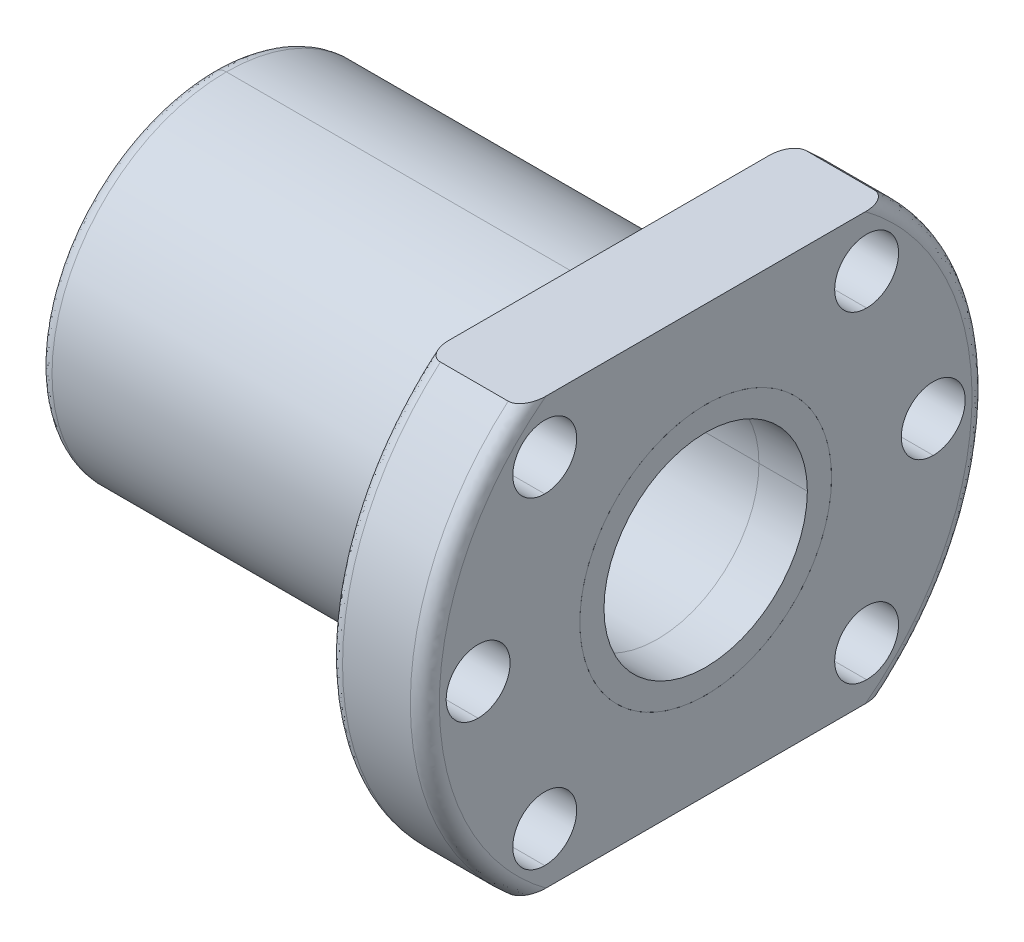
ISO-10303-21;
HEADER;
FILE_DESCRIPTION(('STEP AP214'),'2;1');
FILE_NAME('part.step','',(''),(''),'','','');
FILE_SCHEMA(('AUTOMOTIVE_DESIGN { 1 0 10303 214 1 1 1 1 }'));
ENDSEC;
DATA;
#1=APPLICATION_CONTEXT('core data for automotive mechanical design processes');
#2=APPLICATION_PROTOCOL_DEFINITION('international standard','automotive_design',2000,#1);
#3=PRODUCT_CONTEXT('',#1,'mechanical');
#4=PRODUCT('Part','Part','',(#3));
#5=PRODUCT_RELATED_PRODUCT_CATEGORY('part','',(#4));
#6=PRODUCT_DEFINITION_FORMATION('','',#4);
#7=PRODUCT_DEFINITION_CONTEXT('part definition',#1,'design');
#8=PRODUCT_DEFINITION('design','',#6,#7);
#9=PRODUCT_DEFINITION_SHAPE('','',#8);
#10=(LENGTH_UNIT() NAMED_UNIT(*) SI_UNIT(.MILLI.,.METRE.));
#11=(NAMED_UNIT(*) PLANE_ANGLE_UNIT() SI_UNIT($,.RADIAN.));
#12=(NAMED_UNIT(*) SI_UNIT($,.STERADIAN.) SOLID_ANGLE_UNIT());
#13=UNCERTAINTY_MEASURE_WITH_UNIT(LENGTH_MEASURE(1.E-05),#10,'distance_accuracy_value','');
#14=(GEOMETRIC_REPRESENTATION_CONTEXT(3) GLOBAL_UNCERTAINTY_ASSIGNED_CONTEXT((#13)) GLOBAL_UNIT_ASSIGNED_CONTEXT((#10,
#11,#12)) REPRESENTATION_CONTEXT('',''));
#15=CARTESIAN_POINT('',(0.,0.,0.));
#16=DIRECTION('',(0.,0.,1.));
#17=DIRECTION('',(1.,0.,0.));
#18=AXIS2_PLACEMENT_3D('',#15,#16,#17);
#19=CARTESIAN_POINT('',(-66.,16.5,0.));
#20=CARTESIAN_POINT('',(-66.,16.5,-33.));
#21=CARTESIAN_POINT('',(-66.,-16.5,-33.));
#22=CARTESIAN_POINT('',(-66.,-16.5,0.));
#23=CARTESIAN_POINT('',(-66.,17.3786796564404,0.));
#24=CARTESIAN_POINT('',(-65.9999999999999,17.3786796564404,-34.7573593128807));
#25=CARTESIAN_POINT('',(-65.9999999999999,-17.3786796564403,-34.7573593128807));
#26=CARTESIAN_POINT('',(-65.9999999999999,-17.3786796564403,0.));
#27=CARTESIAN_POINT('',(-65.3786796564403,18.,0.));
#28=CARTESIAN_POINT('',(-65.3786796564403,18.,-36.));
#29=CARTESIAN_POINT('',(-65.3786796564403,-18.,-36.));
#30=CARTESIAN_POINT('',(-65.3786796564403,-18.,0.));
#31=CARTESIAN_POINT('',(-64.5,18.,0.));
#32=CARTESIAN_POINT('',(-64.5,18.,-36.));
#33=CARTESIAN_POINT('',(-64.5,-18.,-36.));
#34=CARTESIAN_POINT('',(-64.5,-18.,0.));
#35=(BOUNDED_SURFACE() B_SPLINE_SURFACE(3,3,((#19,#20,#21,#22),(#23,#24,#25,#26),(#27,#28,#29,
#30),(#31,#32,#33,#34)),.UNSPECIFIED.,.F.,.F.,.F.) B_SPLINE_SURFACE_WITH_KNOTS((4,4),(4,4),(0.,
1.),(0.,1.),.UNSPECIFIED.) GEOMETRIC_REPRESENTATION_ITEM() RATIONAL_B_SPLINE_SURFACE(((1.,
0.333333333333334,0.333333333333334,1.),(0.804737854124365,0.268245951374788,0.268245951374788,
0.804737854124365),(0.804737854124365,0.268245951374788,0.268245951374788,0.804737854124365),
(1.,0.333333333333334,0.333333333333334,1.))) REPRESENTATION_ITEM('') SURFACE());
#36=CARTESIAN_POINT('',(-66.,-16.5,0.));
#37=CARTESIAN_POINT('',(-66.,-16.5,-33.));
#38=CARTESIAN_POINT('',(-66.,16.5,-33.));
#39=CARTESIAN_POINT('',(-66.,16.5,0.));
#40=(BOUNDED_CURVE() B_SPLINE_CURVE(3,(#36,#37,#38,#39),.UNSPECIFIED.,.F.,
.F.) B_SPLINE_CURVE_WITH_KNOTS((4,4),(0.,1.),
.UNSPECIFIED.) CURVE() GEOMETRIC_REPRESENTATION_ITEM() RATIONAL_B_SPLINE_CURVE((1.,
0.333333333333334,0.333333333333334,1.)) REPRESENTATION_ITEM(''));
#41=CARTESIAN_POINT('',(-66.,-16.5,0.));
#42=VERTEX_POINT('',#41);
#43=CARTESIAN_POINT('',(-66.,16.5,0.));
#44=VERTEX_POINT('',#43);
#45=EDGE_CURVE('P0_E701',#42,#44,#40,.T.);
#46=CARTESIAN_POINT('',(-64.5,16.5,0.));
#47=DIRECTION('',(0.,0.,-1.));
#48=DIRECTION('',(0.,1.,0.));
#49=AXIS2_PLACEMENT_3D('',#46,#47,#48);
#50=CIRCLE('',#49,1.5);
#51=CARTESIAN_POINT('',(-64.5,18.,0.));
#52=VERTEX_POINT('',#51);
#53=EDGE_CURVE('P0_E206',#44,#52,#50,.T.);
#54=CARTESIAN_POINT('',(-64.5,0.,0.));
#55=DIRECTION('',(1.,0.,0.));
#56=DIRECTION('',(0.,1.,0.));
#57=AXIS2_PLACEMENT_3D('',#54,#55,#56);
#58=CIRCLE('',#57,18.);
#59=CARTESIAN_POINT('',(-64.5,-18.,0.));
#60=VERTEX_POINT('',#59);
#61=EDGE_CURVE('P0_E11',#60,#52,#58,.T.);
#62=CARTESIAN_POINT('',(-64.5,-16.5,0.));
#63=DIRECTION('',(0.,0.,1.));
#64=DIRECTION('',(0.,-1.,0.));
#65=AXIS2_PLACEMENT_3D('',#62,#63,#64);
#66=CIRCLE('',#65,1.5);
#67=EDGE_CURVE('P0_E210',#42,#60,#66,.T.);
#68=ORIENTED_EDGE('',*,*,#45,.T.);
#69=ORIENTED_EDGE('',*,*,#53,.T.);
#70=ORIENTED_EDGE('',*,*,#61,.F.);
#71=ORIENTED_EDGE('',*,*,#67,.F.);
#72=EDGE_LOOP('',(#68,#69,#70,#71));
#73=FACE_BOUND('',#72,.T.);
#74=ADVANCED_FACE('P0_F17',(#73),#35,.T.);
#75=CARTESIAN_POINT('',(-64.5,0.,0.));
#76=DIRECTION('',(1.,0.,0.));
#77=DIRECTION('',(0.,1.,0.));
#78=AXIS2_PLACEMENT_3D('',#75,#76,#77);
#79=CYLINDRICAL_SURFACE('',#78,18.);
#80=DIRECTION('',(1.,0.,0.));
#81=VECTOR('',#80,1.);
#82=CARTESIAN_POINT('',(-64.5,-18.,0.));
#83=LINE('',#82,#81);
#84=CARTESIAN_POINT('',(-25.,-18.,0.));
#85=VERTEX_POINT('',#84);
#86=EDGE_CURVE('P0_E1079',#60,#85,#83,.T.);
#87=ORIENTED_EDGE('',*,*,#86,.F.);
#88=ORIENTED_EDGE('',*,*,#61,.T.);
#89=DIRECTION('',(1.,0.,0.));
#90=VECTOR('',#89,1.);
#91=CARTESIAN_POINT('',(-64.5,18.,0.));
#92=LINE('',#91,#90);
#93=CARTESIAN_POINT('',(-25.,18.,0.));
#94=VERTEX_POINT('',#93);
#95=EDGE_CURVE('P0_E1049',#52,#94,#92,.T.);
#96=ORIENTED_EDGE('',*,*,#95,.T.);
#97=CARTESIAN_POINT('',(-25.,0.,0.));
#98=DIRECTION('',(-1.,0.,0.));
#99=DIRECTION('',(0.,1.,0.));
#100=AXIS2_PLACEMENT_3D('',#97,#98,#99);
#101=CIRCLE('',#100,18.);
#102=EDGE_CURVE('P0_E217',#94,#85,#101,.T.);
#103=ORIENTED_EDGE('',*,*,#102,.T.);
#104=EDGE_LOOP('',(#87,#88,#96,#103));
#105=FACE_BOUND('',#104,.T.);
#106=ADVANCED_FACE('P0_F1183',(#105),#79,.T.);
#107=CARTESIAN_POINT('',(-15.,16.62,16.62));
#108=DIRECTION('',(-1.,0.,0.));
#109=DIRECTION('',(0.,-1.,0.));
#110=AXIS2_PLACEMENT_3D('',#107,#108,#109);
#111=CYLINDRICAL_SURFACE('',#110,3.3);
#112=CARTESIAN_POINT('',(-15.,16.62,16.62));
#113=DIRECTION('',(-1.,0.,0.));
#114=DIRECTION('',(0.,-1.,0.));
#115=AXIS2_PLACEMENT_3D('',#112,#113,#114);
#116=CIRCLE('',#115,3.3);
#117=CARTESIAN_POINT('',(-15.,19.92,16.62));
#118=VERTEX_POINT('',#117);
#119=CARTESIAN_POINT('',(-15.,13.32,16.62));
#120=VERTEX_POINT('',#119);
#121=EDGE_CURVE('P0_E57',#118,#120,#116,.T.);
#122=ORIENTED_EDGE('',*,*,#121,.F.);
#123=DIRECTION('',(-1.,0.,0.));
#124=VECTOR('',#123,1.);
#125=CARTESIAN_POINT('',(-15.,19.92,16.62));
#126=LINE('',#125,#124);
#127=CARTESIAN_POINT('',(-25.,19.92,16.62));
#128=VERTEX_POINT('',#127);
#129=EDGE_CURVE('P0_E175',#118,#128,#126,.T.);
#130=ORIENTED_EDGE('',*,*,#129,.T.);
#131=CARTESIAN_POINT('',(-25.,16.62,16.62));
#132=DIRECTION('',(-1.,0.,0.));
#133=DIRECTION('',(0.,-1.,0.));
#134=AXIS2_PLACEMENT_3D('',#131,#132,#133);
#135=CIRCLE('',#134,3.3);
#136=CARTESIAN_POINT('',(-25.,13.32,16.62));
#137=VERTEX_POINT('',#136);
#138=EDGE_CURVE('P0_E44',#128,#137,#135,.T.);
#139=ORIENTED_EDGE('',*,*,#138,.T.);
#140=DIRECTION('',(-1.,0.,0.));
#141=VECTOR('',#140,1.);
#142=CARTESIAN_POINT('',(-15.,13.32,16.62));
#143=LINE('',#142,#141);
#144=EDGE_CURVE('P0_E177',#120,#137,#143,.T.);
#145=ORIENTED_EDGE('',*,*,#144,.F.);
#146=EDGE_LOOP('',(#122,#130,#139,#145));
#147=FACE_BOUND('',#146,.T.);
#148=ADVANCED_FACE('P0_F173',(#147),#111,.F.);
#149=CARTESIAN_POINT('',(-14.9999999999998,-16.62,16.62));
#150=DIRECTION('',(-1.,0.,0.));
#151=DIRECTION('',(0.,-1.,0.));
#152=AXIS2_PLACEMENT_3D('',#149,#150,#151);
#153=CYLINDRICAL_SURFACE('',#152,3.3);
#154=CARTESIAN_POINT('',(-14.9999999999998,-16.62,16.62));
#155=DIRECTION('',(-1.,0.,0.));
#156=DIRECTION('',(0.,-1.,0.));
#157=AXIS2_PLACEMENT_3D('',#154,#155,#156);
#158=CIRCLE('',#157,3.3);
#159=CARTESIAN_POINT('',(-14.9999999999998,-13.32,16.62));
#160=VERTEX_POINT('',#159);
#161=CARTESIAN_POINT('',(-14.9999999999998,-19.92,16.62));
#162=VERTEX_POINT('',#161);
#163=EDGE_CURVE('P0_E180',#160,#162,#158,.T.);
#164=ORIENTED_EDGE('',*,*,#163,.F.);
#165=DIRECTION('',(-1.,0.,0.));
#166=VECTOR('',#165,1.);
#167=CARTESIAN_POINT('',(-14.9999999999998,-13.32,16.62));
#168=LINE('',#167,#166);
#169=CARTESIAN_POINT('',(-25.,-13.32,16.62));
#170=VERTEX_POINT('',#169);
#171=EDGE_CURVE('P0_E684',#160,#170,#168,.T.);
#172=ORIENTED_EDGE('',*,*,#171,.T.);
#173=CARTESIAN_POINT('',(-25.,-16.62,16.62));
#174=DIRECTION('',(-1.,0.,0.));
#175=DIRECTION('',(0.,-1.,0.));
#176=AXIS2_PLACEMENT_3D('',#173,#174,#175);
#177=CIRCLE('',#176,3.3);
#178=CARTESIAN_POINT('',(-25.,-19.92,16.62));
#179=VERTEX_POINT('',#178);
#180=EDGE_CURVE('P0_E218',#170,#179,#177,.T.);
#181=ORIENTED_EDGE('',*,*,#180,.T.);
#182=DIRECTION('',(-1.,0.,0.));
#183=VECTOR('',#182,1.);
#184=CARTESIAN_POINT('',(-14.9999999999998,-19.92,16.62));
#185=LINE('',#184,#183);
#186=EDGE_CURVE('P0_E199',#162,#179,#185,.T.);
#187=ORIENTED_EDGE('',*,*,#186,.F.);
#188=EDGE_LOOP('',(#164,#172,#181,#187));
#189=FACE_BOUND('',#188,.T.);
#190=ADVANCED_FACE('P0_F685',(#189),#153,.F.);
#191=CARTESIAN_POINT('',(-14.9999999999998,-16.62,-16.62));
#192=DIRECTION('',(-1.,0.,0.));
#193=DIRECTION('',(0.,-1.,0.));
#194=AXIS2_PLACEMENT_3D('',#191,#192,#193);
#195=CYLINDRICAL_SURFACE('',#194,3.3);
#196=CARTESIAN_POINT('',(-14.9999999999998,-16.62,-16.62));
#197=DIRECTION('',(-1.,0.,0.));
#198=DIRECTION('',(0.,-1.,0.));
#199=AXIS2_PLACEMENT_3D('',#196,#197,#198);
#200=CIRCLE('',#199,3.3);
#201=CARTESIAN_POINT('',(-14.9999999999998,-13.32,-16.62));
#202=VERTEX_POINT('',#201);
#203=CARTESIAN_POINT('',(-14.9999999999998,-19.92,-16.62));
#204=VERTEX_POINT('',#203);
#205=EDGE_CURVE('P0_E246',#202,#204,#200,.T.);
#206=ORIENTED_EDGE('',*,*,#205,.F.);
#207=DIRECTION('',(-1.,0.,0.));
#208=VECTOR('',#207,1.);
#209=CARTESIAN_POINT('',(-14.9999999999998,-13.32,-16.62));
#210=LINE('',#209,#208);
#211=CARTESIAN_POINT('',(-25.,-13.32,-16.62));
#212=VERTEX_POINT('',#211);
#213=EDGE_CURVE('P0_E751',#202,#212,#210,.T.);
#214=ORIENTED_EDGE('',*,*,#213,.T.);
#215=CARTESIAN_POINT('',(-25.,-16.62,-16.62));
#216=DIRECTION('',(-1.,0.,0.));
#217=DIRECTION('',(0.,-1.,0.));
#218=AXIS2_PLACEMENT_3D('',#215,#216,#217);
#219=CIRCLE('',#218,3.3);
#220=CARTESIAN_POINT('',(-25.,-19.92,-16.62));
#221=VERTEX_POINT('',#220);
#222=EDGE_CURVE('P0_E229',#212,#221,#219,.T.);
#223=ORIENTED_EDGE('',*,*,#222,.T.);
#224=DIRECTION('',(-1.,0.,0.));
#225=VECTOR('',#224,1.);
#226=CARTESIAN_POINT('',(-14.9999999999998,-19.92,-16.62));
#227=LINE('',#226,#225);
#228=EDGE_CURVE('P0_E697',#204,#221,#227,.T.);
#229=ORIENTED_EDGE('',*,*,#228,.F.);
#230=EDGE_LOOP('',(#206,#214,#223,#229));
#231=FACE_BOUND('',#230,.T.);
#232=ADVANCED_FACE('P0_F416',(#231),#195,.F.);
#233=CARTESIAN_POINT('',(-15.,16.62,-16.62));
#234=DIRECTION('',(-1.,0.,0.));
#235=DIRECTION('',(0.,-1.,0.));
#236=AXIS2_PLACEMENT_3D('',#233,#234,#235);
#237=CYLINDRICAL_SURFACE('',#236,3.3);
#238=CARTESIAN_POINT('',(-15.,16.62,-16.62));
#239=DIRECTION('',(-1.,0.,0.));
#240=DIRECTION('',(0.,-1.,0.));
#241=AXIS2_PLACEMENT_3D('',#238,#239,#240);
#242=CIRCLE('',#241,3.3);
#243=CARTESIAN_POINT('',(-15.,19.92,-16.62));
#244=VERTEX_POINT('',#243);
#245=CARTESIAN_POINT('',(-15.,13.32,-16.62));
#246=VERTEX_POINT('',#245);
#247=EDGE_CURVE('P0_E243',#244,#246,#242,.T.);
#248=ORIENTED_EDGE('',*,*,#247,.F.);
#249=DIRECTION('',(-1.,0.,0.));
#250=VECTOR('',#249,1.);
#251=CARTESIAN_POINT('',(-15.,19.92,-16.62));
#252=LINE('',#251,#250);
#253=CARTESIAN_POINT('',(-25.,19.92,-16.62));
#254=VERTEX_POINT('',#253);
#255=EDGE_CURVE('P0_E740',#244,#254,#252,.T.);
#256=ORIENTED_EDGE('',*,*,#255,.T.);
#257=CARTESIAN_POINT('',(-25.,16.62,-16.62));
#258=DIRECTION('',(-1.,0.,0.));
#259=DIRECTION('',(0.,-1.,0.));
#260=AXIS2_PLACEMENT_3D('',#257,#258,#259);
#261=CIRCLE('',#260,3.3);
#262=CARTESIAN_POINT('',(-25.,13.32,-16.62));
#263=VERTEX_POINT('',#262);
#264=EDGE_CURVE('P0_E226',#254,#263,#261,.T.);
#265=ORIENTED_EDGE('',*,*,#264,.T.);
#266=DIRECTION('',(-1.,0.,0.));
#267=VECTOR('',#266,1.);
#268=CARTESIAN_POINT('',(-15.,13.32,-16.62));
#269=LINE('',#268,#267);
#270=EDGE_CURVE('P0_E739',#246,#263,#269,.T.);
#271=ORIENTED_EDGE('',*,*,#270,.F.);
#272=EDGE_LOOP('',(#248,#256,#265,#271));
#273=FACE_BOUND('',#272,.T.);
#274=ADVANCED_FACE('P0_F1224',(#273),#237,.F.);
#275=CARTESIAN_POINT('',(-15.,0.,23.5));
#276=DIRECTION('',(-1.,0.,0.));
#277=DIRECTION('',(0.,-1.,0.));
#278=AXIS2_PLACEMENT_3D('',#275,#276,#277);
#279=CYLINDRICAL_SURFACE('',#278,3.3);
#280=CARTESIAN_POINT('',(-14.9999999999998,0.,23.5));
#281=DIRECTION('',(-1.,0.,0.));
#282=DIRECTION('',(0.,-1.,0.));
#283=AXIS2_PLACEMENT_3D('',#280,#281,#282);
#284=CIRCLE('',#283,3.3);
#285=CARTESIAN_POINT('',(-14.9999999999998,3.30000000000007,23.5));
#286=VERTEX_POINT('',#285);
#287=CARTESIAN_POINT('',(-14.9999999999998,-3.29999999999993,23.5));
#288=VERTEX_POINT('',#287);
#289=EDGE_CURVE('P0_E239',#286,#288,#284,.T.);
#290=ORIENTED_EDGE('',*,*,#289,.F.);
#291=DIRECTION('',(-1.,0.,0.));
#292=VECTOR('',#291,1.);
#293=CARTESIAN_POINT('',(-15.,3.30000000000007,23.5));
#294=LINE('',#293,#292);
#295=CARTESIAN_POINT('',(-25.,3.30000000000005,23.5));
#296=VERTEX_POINT('',#295);
#297=EDGE_CURVE('P0_E730',#286,#296,#294,.T.);
#298=ORIENTED_EDGE('',*,*,#297,.T.);
#299=CARTESIAN_POINT('',(-25.,0.,23.5));
#300=DIRECTION('',(-1.,0.,0.));
#301=DIRECTION('',(0.,-1.,0.));
#302=AXIS2_PLACEMENT_3D('',#299,#300,#301);
#303=CIRCLE('',#302,3.3);
#304=CARTESIAN_POINT('',(-25.,-3.29999999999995,23.5));
#305=VERTEX_POINT('',#304);
#306=EDGE_CURVE('P0_E222',#296,#305,#303,.T.);
#307=ORIENTED_EDGE('',*,*,#306,.T.);
#308=DIRECTION('',(-1.,0.,0.));
#309=VECTOR('',#308,1.);
#310=CARTESIAN_POINT('',(-15.,-3.29999999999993,23.5));
#311=LINE('',#310,#309);
#312=EDGE_CURVE('P0_E729',#288,#305,#311,.T.);
#313=ORIENTED_EDGE('',*,*,#312,.F.);
#314=EDGE_LOOP('',(#290,#298,#307,#313));
#315=FACE_BOUND('',#314,.T.);
#316=ADVANCED_FACE('P0_F1218',(#315),#279,.F.);
#317=CARTESIAN_POINT('',(-15.,0.,-23.5));
#318=DIRECTION('',(-1.,0.,0.));
#319=DIRECTION('',(0.,-1.,0.));
#320=AXIS2_PLACEMENT_3D('',#317,#318,#319);
#321=CYLINDRICAL_SURFACE('',#320,3.3);
#322=CARTESIAN_POINT('',(-14.9999999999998,0.,-23.5));
#323=DIRECTION('',(-1.,0.,0.));
#324=DIRECTION('',(0.,-1.,0.));
#325=AXIS2_PLACEMENT_3D('',#322,#323,#324);
#326=CIRCLE('',#325,3.3);
#327=CARTESIAN_POINT('',(-14.9999999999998,3.30000000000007,-23.5));
#328=VERTEX_POINT('',#327);
#329=CARTESIAN_POINT('',(-14.9999999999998,-3.29999999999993,-23.5));
#330=VERTEX_POINT('',#329);
#331=EDGE_CURVE('P0_E236',#328,#330,#326,.T.);
#332=ORIENTED_EDGE('',*,*,#331,.F.);
#333=DIRECTION('',(-1.,0.,0.));
#334=VECTOR('',#333,1.);
#335=CARTESIAN_POINT('',(-15.,3.30000000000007,-23.5));
#336=LINE('',#335,#334);
#337=CARTESIAN_POINT('',(-25.,3.30000000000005,-23.5));
#338=VERTEX_POINT('',#337);
#339=EDGE_CURVE('P0_E712',#328,#338,#336,.T.);
#340=ORIENTED_EDGE('',*,*,#339,.T.);
#341=CARTESIAN_POINT('',(-25.,0.,-23.5));
#342=DIRECTION('',(-1.,0.,0.));
#343=DIRECTION('',(0.,-1.,0.));
#344=AXIS2_PLACEMENT_3D('',#341,#342,#343);
#345=CIRCLE('',#344,3.3);
#346=CARTESIAN_POINT('',(-25.,-3.29999999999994,-23.5));
#347=VERTEX_POINT('',#346);
#348=EDGE_CURVE('P0_E219',#338,#347,#345,.T.);
#349=ORIENTED_EDGE('',*,*,#348,.T.);
#350=DIRECTION('',(-1.,0.,0.));
#351=VECTOR('',#350,1.);
#352=CARTESIAN_POINT('',(-15.,-3.29999999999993,-23.5));
#353=LINE('',#352,#351);
#354=EDGE_CURVE('P0_E720',#330,#347,#353,.T.);
#355=ORIENTED_EDGE('',*,*,#354,.F.);
#356=EDGE_LOOP('',(#332,#340,#349,#355));
#357=FACE_BOUND('',#356,.T.);
#358=ADVANCED_FACE('P0_F1214',(#357),#321,.F.);
#359=CARTESIAN_POINT('',(-61.,0.,0.));
#360=DIRECTION('',(-1.,0.,0.));
#361=DIRECTION('',(0.,0.,1.));
#362=AXIS2_PLACEMENT_3D('',#359,#360,#361);
#363=CYLINDRICAL_SURFACE('',#362,10.5);
#364=DIRECTION('',(-1.,0.,0.));
#365=VECTOR('',#364,1.);
#366=CARTESIAN_POINT('',(-61.,0.,-10.5));
#367=LINE('',#366,#365);
#368=CARTESIAN_POINT('',(-20.,0.,-10.5));
#369=VERTEX_POINT('',#368);
#370=CARTESIAN_POINT('',(-66.,0.,-10.5));
#371=VERTEX_POINT('',#370);
#372=EDGE_CURVE('P0_E1022',#369,#371,#367,.T.);
#373=ORIENTED_EDGE('',*,*,#372,.F.);
#374=CARTESIAN_POINT('',(-20.,0.,0.));
#375=DIRECTION('',(-1.,0.,0.));
#376=DIRECTION('',(0.,-1.,0.));
#377=AXIS2_PLACEMENT_3D('',#374,#375,#376);
#378=CIRCLE('',#377,10.5);
#379=CARTESIAN_POINT('',(-20.,0.,10.5));
#380=VERTEX_POINT('',#379);
#381=EDGE_CURVE('P0_E882',#380,#369,#378,.T.);
#382=ORIENTED_EDGE('',*,*,#381,.F.);
#383=DIRECTION('',(-1.,0.,0.));
#384=VECTOR('',#383,1.);
#385=CARTESIAN_POINT('',(-61.,0.,10.5));
#386=LINE('',#385,#384);
#387=CARTESIAN_POINT('',(-66.,0.,10.5));
#388=VERTEX_POINT('',#387);
#389=EDGE_CURVE('P0_E322',#380,#388,#386,.T.);
#390=ORIENTED_EDGE('',*,*,#389,.T.);
#391=CARTESIAN_POINT('',(-66.,0.,0.));
#392=DIRECTION('',(1.,0.,0.));
#393=DIRECTION('',(0.,0.,1.));
#394=AXIS2_PLACEMENT_3D('',#391,#392,#393);
#395=CIRCLE('',#394,10.5);
#396=EDGE_CURVE('P0_E711',#371,#388,#395,.T.);
#397=ORIENTED_EDGE('',*,*,#396,.F.);
#398=EDGE_LOOP('',(#373,#382,#390,#397));
#399=FACE_BOUND('',#398,.T.);
#400=ADVANCED_FACE('P0_F1157',(#399),#363,.F.);
#401=CARTESIAN_POINT('',(0.,1.137E-13,0.));
#402=DIRECTION('',(-1.,0.,0.));
#403=DIRECTION('',(0.,-1.,0.));
#404=AXIS2_PLACEMENT_3D('',#401,#402,#403);
#405=CYLINDRICAL_SURFACE('',#404,13.);
#406=CARTESIAN_POINT('',(-14.9999999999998,0.,0.));
#407=DIRECTION('',(-1.,0.,0.));
#408=DIRECTION('',(0.,-1.,0.));
#409=AXIS2_PLACEMENT_3D('',#406,#407,#408);
#410=CIRCLE('',#409,13.);
#411=CARTESIAN_POINT('',(-14.9999999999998,13.,0.));
#412=VERTEX_POINT('',#411);
#413=CARTESIAN_POINT('',(-14.9999999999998,-12.9999999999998,0.));
#414=VERTEX_POINT('',#413);
#415=EDGE_CURVE('P0_E30',#412,#414,#410,.T.);
#416=ORIENTED_EDGE('',*,*,#415,.F.);
#417=DIRECTION('',(-1.,0.,0.));
#418=VECTOR('',#417,1.);
#419=CARTESIAN_POINT('',(0.,13.,0.));
#420=LINE('',#419,#418);
#421=CARTESIAN_POINT('',(-20.,13.,0.));
#422=VERTEX_POINT('',#421);
#423=EDGE_CURVE('P0_E868',#412,#422,#420,.T.);
#424=ORIENTED_EDGE('',*,*,#423,.T.);
#425=CARTESIAN_POINT('',(-20.,0.,0.));
#426=DIRECTION('',(1.,0.,0.));
#427=DIRECTION('',(0.,-1.,0.));
#428=AXIS2_PLACEMENT_3D('',#425,#426,#427);
#429=CIRCLE('',#428,13.);
#430=CARTESIAN_POINT('',(-20.,-12.9999999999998,0.));
#431=VERTEX_POINT('',#430);
#432=EDGE_CURVE('P0_E900',#431,#422,#429,.T.);
#433=ORIENTED_EDGE('',*,*,#432,.F.);
#434=DIRECTION('',(-1.,0.,0.));
#435=VECTOR('',#434,1.);
#436=CARTESIAN_POINT('',(0.,-12.9999999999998,0.));
#437=LINE('',#436,#435);
#438=EDGE_CURVE('P0_E852',#414,#431,#437,.T.);
#439=ORIENTED_EDGE('',*,*,#438,.F.);
#440=EDGE_LOOP('',(#416,#424,#433,#439));
#441=FACE_BOUND('',#440,.T.);
#442=ADVANCED_FACE('P0_F1172',(#441),#405,.F.);
#443=CARTESIAN_POINT('',(-16.5,23.3921789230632,-17.1407690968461));
#444=CARTESIAN_POINT('',(-16.4999999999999,10.7199225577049,-34.4347240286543));
#445=CARTESIAN_POINT('',(-16.4999999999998,-10.7199225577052,-34.4347240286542));
#446=CARTESIAN_POINT('',(-16.5,-23.3921789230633,-17.1407690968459));
#447=CARTESIAN_POINT('',(-15.6213203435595,23.3921789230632,-17.1407690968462));
#448=CARTESIAN_POINT('',(-15.6213203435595,10.7199225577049,-34.4347240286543));
#449=CARTESIAN_POINT('',(-15.6213203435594,-10.7199225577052,-34.4347240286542));
#450=CARTESIAN_POINT('',(-15.6213203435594,-23.3921789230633,-17.1407690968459));
#451=CARTESIAN_POINT('',(-14.9999999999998,22.8910052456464,-16.7735308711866));
#452=CARTESIAN_POINT('',(-14.9999999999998,10.4902499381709,-33.6969655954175));
#453=CARTESIAN_POINT('',(-14.9999999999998,-10.4902499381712,-33.6969655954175));
#454=CARTESIAN_POINT('',(-14.9999999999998,-22.8910052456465,-16.7735308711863));
#455=CARTESIAN_POINT('',(-14.9999999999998,22.1822386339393,-16.2541775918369));
#456=CARTESIAN_POINT('',(-14.9999999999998,10.1654438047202,-32.6536176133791));
#457=CARTESIAN_POINT('',(-14.9999999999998,-10.1654438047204,-32.6536176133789));
#458=CARTESIAN_POINT('',(-14.9999999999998,-22.1822386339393,-16.2541775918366));
#459=(BOUNDED_SURFACE() B_SPLINE_SURFACE(3,3,((#443,#444,#445,#446),(#447,#448,#449,#450),(#451,
#452,#453,#454),(#455,#456,#457,#458)),.UNSPECIFIED.,.F.,.F.,
.F.) B_SPLINE_SURFACE_WITH_KNOTS((4,4),(4,4),(0.,1.),(0.,1.),
.UNSPECIFIED.) GEOMETRIC_REPRESENTATION_ITEM() RATIONAL_B_SPLINE_SURFACE(((1.,0.727374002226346,
0.727374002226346,1.),(0.804737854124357,0.585345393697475,0.585345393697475,0.804737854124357),
(0.804737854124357,0.585345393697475,0.585345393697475,0.804737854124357),(1.,0.727374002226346,
0.727374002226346,1.))) REPRESENTATION_ITEM('') SURFACE());
#460=CARTESIAN_POINT('',(-14.9999999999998,-22.,-16.5002478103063));
#461=CARTESIAN_POINT('',(-14.9999999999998,-21.3358791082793,-17.3862948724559));
#462=CARTESIAN_POINT('',(-14.9999999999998,-20.6194444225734,-18.2300122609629));
#463=CARTESIAN_POINT('',(-14.9999999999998,-19.4665001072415,-19.432227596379));
#464=CARTESIAN_POINT('',(-14.9999999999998,-19.0692105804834,-19.8223322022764));
#465=CARTESIAN_POINT('',(-14.9999999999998,-18.2550523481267,-20.5748788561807));
#466=CARTESIAN_POINT('',(-14.9999999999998,-17.4196781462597,-21.3014057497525));
#467=CARTESIAN_POINT('',(-14.9999999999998,-16.5418720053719,-21.975893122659));
#468=CARTESIAN_POINT('',(-14.9999999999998,-15.6428498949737,-22.6243607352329));
#469=CARTESIAN_POINT('',(-14.9999999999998,-15.1789522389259,-22.9378056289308));
#470=CARTESIAN_POINT('',(-14.9999999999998,-13.8011822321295,-23.8111175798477));
#471=CARTESIAN_POINT('',(-14.9999999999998,-12.3788362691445,-24.5987795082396));
#472=CARTESIAN_POINT('',(-14.9999999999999,-10.8275759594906,-25.2854325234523));
#473=CARTESIAN_POINT('',(-14.9999999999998,-10.2597195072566,-25.5145608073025));
#474=CARTESIAN_POINT('',(-14.9999999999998,-10.1332970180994,-25.5650321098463));
#475=CARTESIAN_POINT('',(-14.9999999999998,-10.0721054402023,-25.589196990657));
#476=CARTESIAN_POINT('',(-14.9999999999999,-9.88968739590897,-25.6605098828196));
#477=CARTESIAN_POINT('',(-14.9999999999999,-9.52407765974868,-25.8004653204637));
#478=CARTESIAN_POINT('',(-14.9999999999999,-8.17499850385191,-26.2842614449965));
#479=CARTESIAN_POINT('',(-14.9999999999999,-6.67232988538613,-26.7052251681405));
#480=CARTESIAN_POINT('',(-14.9999999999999,-5.39431778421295,-26.9670167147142));
#481=CARTESIAN_POINT('',(-14.9999999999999,-5.07352534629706,-27.0280140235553));
#482=CARTESIAN_POINT('',(-14.9999999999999,-5.00898345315,-27.0400414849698));
#483=CARTESIAN_POINT('',(-14.9999999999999,-4.88783779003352,-27.0622067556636));
#484=CARTESIAN_POINT('',(-14.9999999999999,-4.70606137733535,-27.0948389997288));
#485=CARTESIAN_POINT('',(-14.9999999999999,-4.03891076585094,-27.2077182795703));
#486=CARTESIAN_POINT('',(-14.9999999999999,-3.43047960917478,-27.2898137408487));
#487=CARTESIAN_POINT('',(-14.9999999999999,-1.96653807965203,-27.4474404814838));
#488=CARTESIAN_POINT('',(-14.9999999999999,-0.985219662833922,-27.4999884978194));
#489=CARTESIAN_POINT('',(-14.9999999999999,0.985641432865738,-27.5000115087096));
#490=CARTESIAN_POINT('',(-14.9999999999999,2.45673744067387,-27.4211906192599));
#491=CARTESIAN_POINT('',(-14.9999999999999,4.0389688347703,-27.207689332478));
#492=CARTESIAN_POINT('',(-14.9999999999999,4.70635494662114,-27.0947780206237));
#493=CARTESIAN_POINT('',(-14.9999999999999,4.88820411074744,-27.0621362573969));
#494=CARTESIAN_POINT('',(-14.9999999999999,5.00940016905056,-27.0399644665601));
#495=CARTESIAN_POINT('',(-14.9999999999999,5.07393822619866,-27.0279392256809));
#496=CARTESIAN_POINT('',(-14.9999999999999,5.39461230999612,-26.9669705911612));
#497=CARTESIAN_POINT('',(-14.9999999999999,6.67222316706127,-26.7052728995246));
#498=CARTESIAN_POINT('',(-14.9999999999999,8.1748433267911,-26.2842967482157));
#499=CARTESIAN_POINT('',(-14.9999999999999,9.52427501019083,-25.8003745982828));
#500=CARTESIAN_POINT('',(-15.,9.89001336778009,-25.6603754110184));
#501=CARTESIAN_POINT('',(-15.,10.0725011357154,-25.5890390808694));
#502=CARTESIAN_POINT('',(-15.,10.1337261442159,-25.5648625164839));
#503=CARTESIAN_POINT('',(-15.,10.26010312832,-25.5144121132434));
#504=CARTESIAN_POINT('',(-14.9999999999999,10.8277623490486,-25.285373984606));
#505=CARTESIAN_POINT('',(-15.,12.3786633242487,-24.5988741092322));
#506=CARTESIAN_POINT('',(-15.,13.8011469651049,-23.8111101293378));
#507=CARTESIAN_POINT('',(-15.,15.1793764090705,-22.9375300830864));
#508=CARTESIAN_POINT('',(-15.,15.6430415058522,-22.6242522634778));
#509=CARTESIAN_POINT('',(-15.,16.5418704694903,-21.9759166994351));
#510=CARTESIAN_POINT('',(-15.,17.4195791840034,-21.3014837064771));
#511=CARTESIAN_POINT('',(-15.,18.2550474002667,-20.5748558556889));
#512=CARTESIAN_POINT('',(-15.,19.0693953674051,-19.8221305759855));
#513=CARTESIAN_POINT('',(-15.,19.4668178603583,-19.4319135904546));
#514=CARTESIAN_POINT('',(-15.,20.6194232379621,-18.2300703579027));
#515=CARTESIAN_POINT('',(-15.,21.3357873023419,-17.3864095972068));
#516=CARTESIAN_POINT('',(-15.,22.,-16.5002330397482));
#517=(BOUNDED_CURVE() B_SPLINE_CURVE(3,(#460,#461,#462,#463,#464,#465,#466,#467,#468,#469,#470,
#471,#472,#473,#474,#475,#476,#477,#478,#479,#480,#481,#482,#483,#484,#485,#486,#487,#488,#489,
#490,#491,#492,#493,#494,#495,#496,#497,#498,#499,#500,#501,#502,#503,#504,#505,#506,#507,#508,
#509,#510,#511,#512,#513,#514,#515,#516),.UNSPECIFIED.,.F.,.F.) B_SPLINE_CURVE_WITH_KNOTS((4,2,
2,1,2,2,1,1,2,2,1,1,1,2,2,1,1,2,2,1,1,1,2,2,1,1,1,2,2,1,1,2,2,1,2,2,4),(0.207012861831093,
0.243636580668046,0.261948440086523,0.280260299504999,0.298572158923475,0.316884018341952,
0.353507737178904,0.371819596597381,0.374108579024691,0.376397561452,0.38097552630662,
0.390131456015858,0.426755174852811,0.435911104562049,0.438200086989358,0.440489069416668,
0.445067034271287,0.463378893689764,0.500002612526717,0.53662633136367,0.554938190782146,
0.559516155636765,0.561805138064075,0.564094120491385,0.573250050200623,0.609873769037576,
0.619029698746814,0.623607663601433,0.625896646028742,0.628185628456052,0.646497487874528,
0.683121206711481,0.701433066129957,0.719744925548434,0.73805678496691,0.756368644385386,
0.792992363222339),
.UNSPECIFIED.) CURVE() GEOMETRIC_REPRESENTATION_ITEM() RATIONAL_B_SPLINE_CURVE((1.,1.,1.,1.,1.,
1.,1.,1.,1.,1.,1.,1.,1.,1.,1.,1.,1.,1.,1.,1.,1.,1.,1.,1.,1.,1.,1.,1.,1.,1.,1.,1.,1.,1.,1.,1.,1.,
1.,1.,1.,1.,1.,1.,1.,1.,1.,1.,1.,1.,1.,1.,1.,1.,1.,1.,1.,1.)) REPRESENTATION_ITEM(''));
#518=CARTESIAN_POINT('',(-14.9999999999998,-22.,-16.5002478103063));
#519=VERTEX_POINT('',#518);
#520=CARTESIAN_POINT('',(-15.,22.,-16.5002330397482));
#521=VERTEX_POINT('',#520);
#522=EDGE_CURVE('P0_E240',#519,#521,#517,.T.);
#523=CARTESIAN_POINT('',(-15.000000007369,-21.9999999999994,-16.5002478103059));
#524=CARTESIAN_POINT('',(-15.0000014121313,-21.9999635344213,-16.5219694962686));
#525=CARTESIAN_POINT('',(-15.0001717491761,-21.9999360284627,-16.5436913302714));
#526=CARTESIAN_POINT('',(-15.0011851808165,-21.9998771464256,-16.6081804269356));
#527=CARTESIAN_POINT('',(-15.0025203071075,-21.9998678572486,-16.6509404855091));
#528=CARTESIAN_POINT('',(-15.007568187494,-21.9998945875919,-16.7580522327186));
#529=CARTESIAN_POINT('',(-15.0121429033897,-21.9999559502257,-16.8223658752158));
#530=CARTESIAN_POINT('',(-15.0229474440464,-22.0000071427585,-16.9348511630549));
#531=CARTESIAN_POINT('',(-15.0284903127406,-22.0000108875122,-16.9830899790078));
#532=CARTESIAN_POINT('',(-15.0406650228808,-22.0000237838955,-17.0735611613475));
#533=CARTESIAN_POINT('',(-15.0470872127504,-22.0000322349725,-17.1158215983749));
#534=CARTESIAN_POINT('',(-15.0604102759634,-22.0000174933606,-17.1941935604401));
#535=CARTESIAN_POINT('',(-15.0671184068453,-21.9999985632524,-17.2303379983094));
#536=CARTESIAN_POINT('',(-15.084161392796,-22.0000019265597,-17.3146818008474));
#537=CARTESIAN_POINT('',(-15.0949530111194,-22.0000404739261,-17.3627900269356));
#538=CARTESIAN_POINT('',(-15.1180993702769,-22.0001318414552,-17.4561510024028));
#539=CARTESIAN_POINT('',(-15.1303526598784,-22.0001838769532,-17.5014289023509));
#540=CARTESIAN_POINT('',(-15.1561683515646,-22.0002551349,-17.5890216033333));
#541=CARTESIAN_POINT('',(-15.1696276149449,-22.0002759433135,-17.6313667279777));
#542=CARTESIAN_POINT('',(-15.1975962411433,-22.0002725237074,-17.7130110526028));
#543=CARTESIAN_POINT('',(-15.212001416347,-22.0002508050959,-17.7523458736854));
#544=CARTESIAN_POINT('',(-15.2416031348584,-22.0001764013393,-17.8279132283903));
#545=CARTESIAN_POINT('',(-15.2566949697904,-22.0001257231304,-17.864186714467));
#546=CARTESIAN_POINT('',(-15.2874233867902,-22.0000401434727,-17.9335994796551));
#547=CARTESIAN_POINT('',(-15.3029546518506,-22.0000044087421,-17.9667851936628));
#548=CARTESIAN_POINT('',(-15.33011212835,-21.9999970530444,-18.0215341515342));
#549=CARTESIAN_POINT('',(-15.3413256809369,-22.0000081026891,-18.0433027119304));
#550=CARTESIAN_POINT('',(-15.3641885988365,-22.0000382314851,-18.0860265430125));
#551=CARTESIAN_POINT('',(-15.3758239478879,-22.0000571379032,-18.1069893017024));
#552=CARTESIAN_POINT('',(-15.3995019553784,-22.0000987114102,-18.1480847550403));
#553=CARTESIAN_POINT('',(-15.4115304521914,-22.0001212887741,-18.1682256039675));
#554=CARTESIAN_POINT('',(-15.4359637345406,-22.0001636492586,-18.2076633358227));
#555=CARTESIAN_POINT('',(-15.4483542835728,-22.0001834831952,-18.2269690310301));
#556=CARTESIAN_POINT('',(-15.4734803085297,-22.0002165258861,-18.264723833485));
#557=CARTESIAN_POINT('',(-15.4862015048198,-22.0002298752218,-18.2831824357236));
#558=CARTESIAN_POINT('',(-15.5119568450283,-22.0002475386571,-18.3192321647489));
#559=CARTESIAN_POINT('',(-15.5249767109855,-22.0002520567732,-18.3368334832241));
#560=CARTESIAN_POINT('',(-15.5512971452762,-22.0002513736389,-18.3711593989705));
#561=CARTESIAN_POINT('',(-15.5645834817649,-22.0002464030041,-18.387894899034));
#562=CARTESIAN_POINT('',(-15.5914045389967,-22.0002276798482,-18.4204815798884));
#563=CARTESIAN_POINT('',(-15.6049251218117,-22.0002141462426,-18.4363443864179));
#564=CARTESIAN_POINT('',(-15.6321824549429,-22.0001807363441,-18.4671797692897));
#565=CARTESIAN_POINT('',(-15.6459052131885,-22.0001610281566,-18.4821647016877));
#566=CARTESIAN_POINT('',(-15.6735351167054,-22.0001194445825,-18.5112398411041));
#567=CARTESIAN_POINT('',(-15.68742846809,-22.000097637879,-18.5253431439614));
#568=CARTESIAN_POINT('',(-15.7153678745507,-22.000056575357,-18.5526527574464));
#569=CARTESIAN_POINT('',(-15.7294004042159,-22.0000372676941,-18.5658728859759));
#570=CARTESIAN_POINT('',(-15.7575886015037,-22.0000103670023,-18.5914129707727));
#571=CARTESIAN_POINT('',(-15.7717310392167,-22.0000024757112,-18.6037475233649));
#572=CARTESIAN_POINT('',(-15.8036070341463,-21.9999969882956,-18.6304577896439));
#573=CARTESIAN_POINT('',(-15.821455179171,-22.0000019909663,-18.6446972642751));
#574=CARTESIAN_POINT('',(-15.8574657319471,-22.0000111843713,-18.6719835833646));
#575=CARTESIAN_POINT('',(-15.8756140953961,-22.0000153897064,-18.6850489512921));
#576=CARTESIAN_POINT('',(-15.9121791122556,-22.0000219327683,-18.7099733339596));
#577=CARTESIAN_POINT('',(-15.9305826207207,-22.0000243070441,-18.7218516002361));
#578=CARTESIAN_POINT('',(-15.9676088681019,-22.000024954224,-18.7443931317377));
#579=CARTESIAN_POINT('',(-15.9862195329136,-22.0000233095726,-18.7550761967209));
#580=CARTESIAN_POINT('',(-16.0236109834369,-22.0000172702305,-18.7752207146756));
#581=CARTESIAN_POINT('',(-16.0423808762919,-22.0000129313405,-18.7847023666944));
#582=CARTESIAN_POINT('',(-16.0800432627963,-22.0000044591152,-18.8024417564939));
#583=CARTESIAN_POINT('',(-16.0989261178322,-22.0000003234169,-18.8107198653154));
#584=CARTESIAN_POINT('',(-16.1283916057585,-21.9999998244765,-18.8226573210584));
#585=CARTESIAN_POINT('',(-16.1388212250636,-22.0000007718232,-18.8266977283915));
#586=CARTESIAN_POINT('',(-16.1597413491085,-22.0000045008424,-18.834429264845));
#587=CARTESIAN_POINT('',(-16.1702311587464,-22.0000072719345,-18.838122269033));
#588=CARTESIAN_POINT('',(-16.191263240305,-22.0000133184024,-18.8451575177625));
#589=CARTESIAN_POINT('',(-16.2018049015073,-22.0000165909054,-18.8485015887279));
#590=CARTESIAN_POINT('',(-16.2229327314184,-22.0000228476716,-18.8548376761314));
#591=CARTESIAN_POINT('',(-16.2335183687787,-22.0000258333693,-18.8578314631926));
#592=CARTESIAN_POINT('',(-16.2547259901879,-22.0000308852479,-18.8634659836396));
#593=CARTESIAN_POINT('',(-16.265347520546,-22.0000329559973,-18.8661084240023));
#594=CARTESIAN_POINT('',(-16.2866187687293,-22.0000358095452,-18.8710395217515));
#595=CARTESIAN_POINT('',(-16.2972681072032,-22.0000365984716,-18.8733298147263));
#596=CARTESIAN_POINT('',(-16.3185867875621,-22.0000367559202,-18.8775561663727));
#597=CARTESIAN_POINT('',(-16.3292558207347,-22.0000361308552,-18.8794937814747));
#598=CARTESIAN_POINT('',(-16.3506057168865,-22.0000335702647,-18.8830146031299));
#599=CARTESIAN_POINT('',(-16.361286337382,-22.0000316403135,-18.8845992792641));
#600=CARTESIAN_POINT('',(-16.3826512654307,-22.0000268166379,-18.8874143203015));
#601=CARTESIAN_POINT('',(-16.3933353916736,-22.0000239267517,-18.888646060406));
#602=CARTESIAN_POINT('',(-16.4146992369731,-22.0000177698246,-18.8907556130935));
#603=CARTESIAN_POINT('',(-16.425378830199,-22.0000145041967,-18.8916346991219));
#604=CARTESIAN_POINT('',(-16.446725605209,-22.0000083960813,-18.8930395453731));
#605=CARTESIAN_POINT('',(-16.4573927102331,-22.0000055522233,-18.8935664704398));
#606=CARTESIAN_POINT('',(-16.4787065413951,-22.0000013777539,-18.8942680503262));
#607=CARTESIAN_POINT('',(-16.4893532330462,-22.0000000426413,-18.8944437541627));
#608=CARTESIAN_POINT('',(-16.5,-22.,-18.8944436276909));
#609=B_SPLINE_CURVE_WITH_KNOTS('',3,(#523,#524,#525,#526,#527,#528,#529,#530,#531,#532,#533,
#534,#535,#536,#537,#538,#539,#540,#541,#542,#543,#544,#545,#546,#547,#548,#549,#550,#551,#552,
#553,#554,#555,#556,#557,#558,#559,#560,#561,#562,#563,#564,#565,#566,#567,#568,#569,#570,#571,
#572,#573,#574,#575,#576,#577,#578,#579,#580,#581,#582,#583,#584,#585,#586,#587,#588,#589,#590,
#591,#592,#593,#594,#595,#596,#597,#598,#599,#600,#601,#602,#603,#604,#605,#606,#607,#608),
.UNSPECIFIED.,.F.,.F.,(4,2,2,2,2,2,2,2,2,2,2,2,2,2,2,2,2,2,2,2,2,2,2,2,2,2,2,2,2,2,2,2,2,2,2,2,
2,2,2,2,2,2,4),(0.,0.0651649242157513,0.193487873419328,0.386832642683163,0.53246841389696,
0.660678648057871,0.770947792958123,0.918809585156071,1.05948562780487,1.19274168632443,
1.31837110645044,1.43619834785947,1.54608209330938,1.61953218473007,1.69144639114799,
1.76181238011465,1.83061974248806,1.8978602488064,1.96352811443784,2.02762027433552,
2.09013666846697,2.15108053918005,2.21045874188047,2.26828207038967,2.32456559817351,
2.39303454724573,2.46009326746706,2.52577608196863,2.59012283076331,2.65317939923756,
2.714998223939,2.74854826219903,2.78190535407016,2.8150780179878,2.84807500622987,
2.88090531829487,2.91357821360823,2.94610322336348,2.97849016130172,3.01074913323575,
3.04289054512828,3.07492510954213,3.10686385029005),.UNSPECIFIED.);
#610=CARTESIAN_POINT('',(-16.5,-22.,-18.8944436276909));
#611=VERTEX_POINT('',#610);
#612=EDGE_CURVE('P0_E344',#519,#611,#609,.T.);
#613=CARTESIAN_POINT('',(-16.5,0.,0.));
#614=DIRECTION('',(-1.,0.,0.));
#615=DIRECTION('',(0.,-1.,0.));
#616=AXIS2_PLACEMENT_3D('',#613,#614,#615);
#617=CIRCLE('',#616,29.);
#618=CARTESIAN_POINT('',(-16.5,22.,-18.8944436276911));
#619=VERTEX_POINT('',#618);
#620=EDGE_CURVE('P0_E505',#619,#611,#617,.T.);
#621=CARTESIAN_POINT('',(-16.5,22.,-18.8944436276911));
#622=CARTESIAN_POINT('',(-16.4849724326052,22.0000001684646,-18.8944441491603));
#623=CARTESIAN_POINT('',(-16.4699454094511,22.0000096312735,-18.8940858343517));
#624=CARTESIAN_POINT('',(-16.4398120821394,22.0000412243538,-18.8926584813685));
#625=CARTESIAN_POINT('',(-16.424706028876,22.0000634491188,-18.8915841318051));
#626=CARTESIAN_POINT('',(-16.3944357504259,22.0001146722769,-18.8887201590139));
#627=CARTESIAN_POINT('',(-16.3792720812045,22.0001437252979,-18.8869246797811));
#628=CARTESIAN_POINT('',(-16.3489078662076,22.0002037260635,-18.8826155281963));
#629=CARTESIAN_POINT('',(-16.3337082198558,22.0002346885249,-18.8800955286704));
#630=CARTESIAN_POINT('',(-16.3032939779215,22.0002943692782,-18.8743351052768));
#631=CARTESIAN_POINT('',(-16.2880806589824,22.0003230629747,-18.871087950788));
#632=CARTESIAN_POINT('',(-16.2576613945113,22.0003749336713,-18.8638719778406));
#633=CARTESIAN_POINT('',(-16.2424571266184,22.0003980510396,-18.8598960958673));
#634=CARTESIAN_POINT('',(-16.2120786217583,22.0004363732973,-18.8512223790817));
#635=CARTESIAN_POINT('',(-16.1969064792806,22.0004514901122,-18.8465172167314));
#636=CARTESIAN_POINT('',(-16.1666151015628,22.0004723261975,-18.8363856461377));
#637=CARTESIAN_POINT('',(-16.1514983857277,22.0004779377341,-18.8309517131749));
#638=CARTESIAN_POINT('',(-16.1213408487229,22.0004792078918,-18.8193643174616));
#639=CARTESIAN_POINT('',(-16.1063029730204,22.0004747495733,-18.8132031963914));
#640=CARTESIAN_POINT('',(-16.0763260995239,22.0004562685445,-18.8001641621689));
#641=CARTESIAN_POINT('',(-16.0613904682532,22.0004421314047,-18.7932785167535));
#642=CARTESIAN_POINT('',(-16.0316409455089,22.000405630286,-18.7787941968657));
#643=CARTESIAN_POINT('',(-16.0168308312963,22.00038316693,-18.7711877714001));
#644=CARTESIAN_POINT('',(-15.9873549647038,22.0003323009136,-18.7552666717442));
#645=CARTESIAN_POINT('',(-15.972693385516,22.0003038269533,-18.7469442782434));
#646=CARTESIAN_POINT('',(-15.9435368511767,22.0002441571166,-18.7295970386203));
#647=CARTESIAN_POINT('',(-15.9290464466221,22.0002129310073,-18.7205645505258));
#648=CARTESIAN_POINT('',(-15.9002540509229,22.0001519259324,-18.7018038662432));
#649=CARTESIAN_POINT('',(-15.8859569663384,22.00012217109,-18.6920681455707));
#650=CARTESIAN_POINT('',(-15.8575723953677,22.000069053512,-18.671908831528));
#651=CARTESIAN_POINT('',(-15.8434901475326,22.000045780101,-18.6614778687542));
#652=CARTESIAN_POINT('',(-15.8155557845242,22.000011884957,-18.6399363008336));
#653=CARTESIAN_POINT('',(-15.8017092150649,22.0000014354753,-18.628818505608));
#654=CARTESIAN_POINT('',(-15.7773308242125,21.9999988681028,-18.6084724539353));
#655=CARTESIAN_POINT('',(-15.7667172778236,22.0000033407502,-18.5993418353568));
#656=CARTESIAN_POINT('',(-15.7455406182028,22.0000187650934,-18.5805897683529));
#657=CARTESIAN_POINT('',(-15.734983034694,22.0000298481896,-18.5709620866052));
#658=CARTESIAN_POINT('',(-15.7030861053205,22.0000689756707,-18.5410432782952));
#659=CARTESIAN_POINT('',(-15.6821911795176,22.0001025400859,-18.5202754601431));
#660=CARTESIAN_POINT('',(-15.6407356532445,22.0001651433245,-18.4768026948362));
#661=CARTESIAN_POINT('',(-15.6202216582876,22.0001939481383,-18.4540535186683));
#662=CARTESIAN_POINT('',(-15.5796323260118,22.0002353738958,-18.4066256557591));
#663=CARTESIAN_POINT('',(-15.5596044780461,22.0002473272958,-18.3819063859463));
#664=CARTESIAN_POINT('',(-15.5200959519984,22.0002505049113,-18.3305565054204));
#665=CARTESIAN_POINT('',(-15.5006633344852,22.0002409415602,-18.3038890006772));
#666=CARTESIAN_POINT('',(-15.4624532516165,22.0002038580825,-18.2486687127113));
#667=CARTESIAN_POINT('',(-15.4437240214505,22.0001757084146,-18.2200826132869));
#668=CARTESIAN_POINT('',(-15.407028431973,22.0001139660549,-18.1610598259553));
#669=CARTESIAN_POINT('',(-15.3891101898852,22.0000802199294,-18.1305932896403));
#670=CARTESIAN_POINT('',(-15.3541374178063,22.0000212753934,-18.0678531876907));
#671=CARTESIAN_POINT('',(-15.3371304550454,21.9999963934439,-18.0355531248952));
#672=CARTESIAN_POINT('',(-15.3087357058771,22.0000026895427,-17.9785249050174));
#673=CARTESIAN_POINT('',(-15.2970186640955,22.0000212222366,-17.9539596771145));
#674=CARTESIAN_POINT('',(-15.2737523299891,22.0000759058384,-17.9031077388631));
#675=CARTESIAN_POINT('',(-15.262247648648,22.0001129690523,-17.8768006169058));
#676=CARTESIAN_POINT('',(-15.2395079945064,22.00018145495,-17.8224721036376));
#677=CARTESIAN_POINT('',(-15.2283173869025,22.0002124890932,-17.794432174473));
#678=CARTESIAN_POINT('',(-15.2063136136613,22.0002575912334,-17.7366508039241));
#679=CARTESIAN_POINT('',(-15.1955446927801,22.000270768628,-17.7068925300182));
#680=CARTESIAN_POINT('',(-15.1744935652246,22.000274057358,-17.6456956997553));
#681=CARTESIAN_POINT('',(-15.1642553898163,22.0002630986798,-17.6142420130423));
#682=CARTESIAN_POINT('',(-15.1443767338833,22.0002237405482,-17.5496836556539));
#683=CARTESIAN_POINT('',(-15.1347800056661,22.000194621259,-17.5165655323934));
#684=CARTESIAN_POINT('',(-15.1162913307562,22.0001216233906,-17.4487163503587));
#685=CARTESIAN_POINT('',(-15.1074425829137,22.0000772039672,-17.4139735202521));
#686=CARTESIAN_POINT('',(-15.0905656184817,22.0000324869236,-17.3429205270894));
#687=CARTESIAN_POINT('',(-15.082580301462,22.0000338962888,-17.3066002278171));
#688=CARTESIAN_POINT('',(-15.0621671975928,21.9999405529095,-17.206256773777));
#689=CARTESIAN_POINT('',(-15.0509279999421,21.9997725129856,-17.1419887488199));
#690=CARTESIAN_POINT('',(-15.0319129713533,21.9992912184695,-17.0133472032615));
#691=CARTESIAN_POINT('',(-15.0241165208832,21.9989788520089,-16.9489766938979));
#692=CARTESIAN_POINT('',(-15.0118412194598,21.9985864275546,-16.8203695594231));
#693=CARTESIAN_POINT('',(-15.0073398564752,21.9985047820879,-16.7561350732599));
#694=CARTESIAN_POINT('',(-15.0014296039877,21.9988285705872,-16.6280069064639));
#695=CARTESIAN_POINT('',(-14.99999778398,21.9992303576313,-16.5641142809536));
#696=CARTESIAN_POINT('',(-15.0000000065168,21.9999999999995,-16.5002330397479));
#697=B_SPLINE_CURVE_WITH_KNOTS('',3,(#621,#622,#623,#624,#625,#626,#627,#628,#629,#630,#631,
#632,#633,#634,#635,#636,#637,#638,#639,#640,#641,#642,#643,#644,#645,#646,#647,#648,#649,#650,
#651,#652,#653,#654,#655,#656,#657,#658,#659,#660,#661,#662,#663,#664,#665,#666,#667,#668,#669,
#670,#671,#672,#673,#674,#675,#676,#677,#678,#679,#680,#681,#682,#683,#684,#685,#686,#687,#688,
#689,#690,#691,#692,#693,#694,#695,#696),.UNSPECIFIED.,.F.,.F.,(4,2,2,2,2,2,2,2,2,2,2,2,2,2,2,2,
2,2,2,2,2,2,2,2,2,2,2,2,2,2,2,2,2,2,2,2,2,4),(0.,0.045077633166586,0.0904934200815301,
0.136285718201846,0.182490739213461,0.229142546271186,0.276273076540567,0.323912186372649,
0.372087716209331,0.420825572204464,0.470149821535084,0.520082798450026,0.570645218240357,
0.621856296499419,0.673733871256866,0.726294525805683,0.7795537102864,0.821549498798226,
0.864409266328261,0.952739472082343,1.04459409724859,1.13999395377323,1.23894224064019,
1.34142683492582,1.44742244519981,1.55689264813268,1.63852867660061,1.72465136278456,
1.81520711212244,1.91013097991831,2.00934738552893,2.11277085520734,2.22030684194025,
2.33185265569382,2.52748097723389,2.72192118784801,2.91502025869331,3.10667171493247),.UNSPECIFIED.);
#698=EDGE_CURVE('P0_E470',#619,#521,#697,.T.);
#699=ORIENTED_EDGE('',*,*,#522,.F.);
#700=ORIENTED_EDGE('',*,*,#612,.T.);
#701=ORIENTED_EDGE('',*,*,#620,.F.);
#702=ORIENTED_EDGE('',*,*,#698,.T.);
#703=EDGE_LOOP('',(#699,#700,#701,#702));
#704=FACE_BOUND('',#703,.T.);
#705=ADVANCED_FACE('P0_F274',(#704),#459,.T.);
#706=CARTESIAN_POINT('',(-16.5,-23.3921789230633,17.1407690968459));
#707=CARTESIAN_POINT('',(-16.4999999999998,-10.7199225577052,34.4347240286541));
#708=CARTESIAN_POINT('',(-16.4999999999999,10.7199225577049,34.4347240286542));
#709=CARTESIAN_POINT('',(-16.5,23.3921789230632,17.1407690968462));
#710=CARTESIAN_POINT('',(-15.6213203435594,-23.3921789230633,17.1407690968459));
#711=CARTESIAN_POINT('',(-15.6213203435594,-10.7199225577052,34.4347240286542));
#712=CARTESIAN_POINT('',(-15.6213203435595,10.7199225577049,34.4347240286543));
#713=CARTESIAN_POINT('',(-15.6213203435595,23.3921789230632,17.1407690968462));
#714=CARTESIAN_POINT('',(-14.9999999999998,-22.8910052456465,16.7735308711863));
#715=CARTESIAN_POINT('',(-14.9999999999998,-10.4902499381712,33.6969655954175));
#716=CARTESIAN_POINT('',(-14.9999999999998,10.4902499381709,33.6969655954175));
#717=CARTESIAN_POINT('',(-14.9999999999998,22.8910052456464,16.7735308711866));
#718=CARTESIAN_POINT('',(-14.9999999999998,-22.1822386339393,16.2541775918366));
#719=CARTESIAN_POINT('',(-14.9999999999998,-10.1654438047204,32.6536176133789));
#720=CARTESIAN_POINT('',(-14.9999999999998,10.1654438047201,32.653617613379));
#721=CARTESIAN_POINT('',(-14.9999999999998,22.1822386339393,16.2541775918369));
#722=(BOUNDED_SURFACE() B_SPLINE_SURFACE(3,3,((#706,#707,#708,#709),(#710,#711,#712,#713),(#714,
#715,#716,#717),(#718,#719,#720,#721)),.UNSPECIFIED.,.F.,.F.,
.F.) B_SPLINE_SURFACE_WITH_KNOTS((4,4),(4,4),(0.,1.),(0.,1.),
.UNSPECIFIED.) GEOMETRIC_REPRESENTATION_ITEM() RATIONAL_B_SPLINE_SURFACE(((1.,0.727374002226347,
0.727374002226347,1.),(0.804737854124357,0.585345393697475,0.585345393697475,0.804737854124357),
(0.804737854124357,0.585345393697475,0.585345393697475,0.804737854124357),(1.,0.727374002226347,
0.727374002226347,1.))) REPRESENTATION_ITEM('') SURFACE());
#723=CARTESIAN_POINT('',(-16.5,0.,0.));
#724=DIRECTION('',(-1.,0.,0.));
#725=DIRECTION('',(0.,-1.,0.));
#726=AXIS2_PLACEMENT_3D('',#723,#724,#725);
#727=CIRCLE('',#726,29.);
#728=CARTESIAN_POINT('',(-16.5,-22.,18.8944436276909));
#729=VERTEX_POINT('',#728);
#730=CARTESIAN_POINT('',(-16.5,22.,18.8944436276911));
#731=VERTEX_POINT('',#730);
#732=EDGE_CURVE('P0_E513',#729,#731,#727,.T.);
#733=CARTESIAN_POINT('',(-16.5,-22.,18.8944436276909));
#734=CARTESIAN_POINT('',(-16.4849724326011,-22.0000001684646,18.89444414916));
#735=CARTESIAN_POINT('',(-16.469945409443,-22.0000096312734,18.8940858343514));
#736=CARTESIAN_POINT('',(-16.4398120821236,-22.0000412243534,18.8926584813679));
#737=CARTESIAN_POINT('',(-16.4247060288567,-22.0000634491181,18.8915841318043));
#738=CARTESIAN_POINT('',(-16.3944357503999,-22.0001146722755,18.8887201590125));
#739=CARTESIAN_POINT('',(-16.3792720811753,-22.0001437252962,18.8869246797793));
#740=CARTESIAN_POINT('',(-16.3489078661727,-22.0002037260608,18.8826155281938));
#741=CARTESIAN_POINT('',(-16.3337082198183,-22.0002346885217,18.8800955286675));
#742=CARTESIAN_POINT('',(-16.3032939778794,-22.000294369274,18.874335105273));
#743=CARTESIAN_POINT('',(-16.2880806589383,-22.00032306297,18.8710879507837));
#744=CARTESIAN_POINT('',(-16.2576613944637,-22.0003749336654,18.8638719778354));
#745=CARTESIAN_POINT('',(-16.2424571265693,-22.0003980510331,18.8598960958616));
#746=CARTESIAN_POINT('',(-16.2120786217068,-22.0004363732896,18.851222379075));
#747=CARTESIAN_POINT('',(-16.1969064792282,-22.000451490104,18.8465172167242));
#748=CARTESIAN_POINT('',(-16.1666151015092,-22.0004723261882,18.8363856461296));
#749=CARTESIAN_POINT('',(-16.1514983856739,-22.0004779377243,18.8309517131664));
#750=CARTESIAN_POINT('',(-16.121340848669,-22.000479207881,18.8193643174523));
#751=CARTESIAN_POINT('',(-16.1063029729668,-22.0004747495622,18.8132031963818));
#752=CARTESIAN_POINT('',(-16.0763260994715,-22.0004562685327,18.8001641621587));
#753=CARTESIAN_POINT('',(-16.0613904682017,-22.0004421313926,18.7932785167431));
#754=CARTESIAN_POINT('',(-16.0316409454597,-22.0004056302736,18.7787941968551));
#755=CARTESIAN_POINT('',(-16.0168308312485,-22.0003831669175,18.7711877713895));
#756=CARTESIAN_POINT('',(-15.9873549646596,-22.0003323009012,18.7552666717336));
#757=CARTESIAN_POINT('',(-15.9726933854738,-22.0003038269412,18.746944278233));
#758=CARTESIAN_POINT('',(-15.9435368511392,-22.0002441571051,18.7295970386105));
#759=CARTESIAN_POINT('',(-15.9290464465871,-22.0002129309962,18.7205645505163));
#760=CARTESIAN_POINT('',(-15.9002540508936,-22.0001519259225,18.7018038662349));
#761=CARTESIAN_POINT('',(-15.8859569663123,-22.0001221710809,18.692068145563));
#762=CARTESIAN_POINT('',(-15.8575723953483,-22.0000690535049,18.6719088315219));
#763=CARTESIAN_POINT('',(-15.8434901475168,-22.000045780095,18.6614778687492));
#764=CARTESIAN_POINT('',(-15.8155557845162,-22.0000118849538,18.6399363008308));
#765=CARTESIAN_POINT('',(-15.8017092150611,-22.0000014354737,18.6288185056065));
#766=CARTESIAN_POINT('',(-15.777330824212,-21.9999988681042,18.6084724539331));
#767=CARTESIAN_POINT('',(-15.7667172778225,-22.0000033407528,18.5993418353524));
#768=CARTESIAN_POINT('',(-15.7455406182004,-22.0000187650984,18.5805897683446));
#769=CARTESIAN_POINT('',(-15.734983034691,-22.0000298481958,18.570962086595));
#770=CARTESIAN_POINT('',(-15.7030861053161,-22.0000689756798,18.5410432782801));
#771=CARTESIAN_POINT('',(-15.6821911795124,-22.0001025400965,18.5202754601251));
#772=CARTESIAN_POINT('',(-15.6407356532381,-22.0001651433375,18.4768026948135));
#773=CARTESIAN_POINT('',(-15.6202216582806,-22.0001939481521,18.4540535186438));
#774=CARTESIAN_POINT('',(-15.5796323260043,-22.0002353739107,18.4066256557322));
#775=CARTESIAN_POINT('',(-15.5596044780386,-22.0002473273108,18.3819063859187));
#776=CARTESIAN_POINT('',(-15.5200959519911,-22.000250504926,18.3305565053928));
#777=CARTESIAN_POINT('',(-15.5006633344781,-22.0002409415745,18.3038890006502));
#778=CARTESIAN_POINT('',(-15.4624532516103,-22.0002038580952,18.2486687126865));
#779=CARTESIAN_POINT('',(-15.4437240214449,-22.0001757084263,18.2200826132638));
#780=CARTESIAN_POINT('',(-15.4070284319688,-22.0001139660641,18.161059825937));
#781=CARTESIAN_POINT('',(-15.3891101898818,-22.0000802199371,18.130593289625));
#782=CARTESIAN_POINT('',(-15.3541374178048,-22.0000212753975,18.0678531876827));
#783=CARTESIAN_POINT('',(-15.3371304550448,-21.999996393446,18.0355531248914));
#784=CARTESIAN_POINT('',(-15.308735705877,-22.0000026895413,17.9785249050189));
#785=CARTESIAN_POINT('',(-15.2970186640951,-22.0000212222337,17.953959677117));
#786=CARTESIAN_POINT('',(-15.273752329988,-22.0000759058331,17.9031077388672));
#787=CARTESIAN_POINT('',(-15.2622476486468,-22.0001129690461,17.8768006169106));
#788=CARTESIAN_POINT('',(-15.2395079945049,-22.0001814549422,17.8224721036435));
#789=CARTESIAN_POINT('',(-15.2283173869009,-22.0002124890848,17.7944321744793));
#790=CARTESIAN_POINT('',(-15.2063136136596,-22.0002575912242,17.7366508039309));
#791=CARTESIAN_POINT('',(-15.1955446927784,-22.0002707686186,17.7068925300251));
#792=CARTESIAN_POINT('',(-15.174493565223,-22.0002740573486,17.6456956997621));
#793=CARTESIAN_POINT('',(-15.1642553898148,-22.0002630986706,17.614242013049));
#794=CARTESIAN_POINT('',(-15.144376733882,-22.0002237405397,17.54968365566));
#795=CARTESIAN_POINT('',(-15.1347800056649,-22.0001946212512,17.5165655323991));
#796=CARTESIAN_POINT('',(-15.1162913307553,-22.0001216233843,17.4487163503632));
#797=CARTESIAN_POINT('',(-15.1074425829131,-22.000077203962,17.413973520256));
#798=CARTESIAN_POINT('',(-15.0905656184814,-22.0000324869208,17.3429205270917));
#799=CARTESIAN_POINT('',(-15.0825803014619,-22.0000338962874,17.3066002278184));
#800=CARTESIAN_POINT('',(-15.0621671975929,-21.999940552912,17.2062567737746));
#801=CARTESIAN_POINT('',(-15.0509279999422,-21.9997725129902,17.1419887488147));
#802=CARTESIAN_POINT('',(-15.0319129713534,-21.9992912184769,17.0133472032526));
#803=CARTESIAN_POINT('',(-15.0241165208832,-21.9989788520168,16.9489766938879));
#804=CARTESIAN_POINT('',(-15.0118412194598,-21.9985864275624,16.8203695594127));
#805=CARTESIAN_POINT('',(-15.0073398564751,-21.998504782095,16.7561350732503));
#806=CARTESIAN_POINT('',(-15.0014296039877,-21.9988285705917,16.6280069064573));
#807=CARTESIAN_POINT('',(-14.9999977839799,-21.9992303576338,16.5641142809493));
#808=CARTESIAN_POINT('',(-15.0000000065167,-21.9999999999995,16.5002330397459));
#809=B_SPLINE_CURVE_WITH_KNOTS('',3,(#733,#734,#735,#736,#737,#738,#739,#740,#741,#742,#743,
#744,#745,#746,#747,#748,#749,#750,#751,#752,#753,#754,#755,#756,#757,#758,#759,#760,#761,#762,
#763,#764,#765,#766,#767,#768,#769,#770,#771,#772,#773,#774,#775,#776,#777,#778,#779,#780,#781,
#782,#783,#784,#785,#786,#787,#788,#789,#790,#791,#792,#793,#794,#795,#796,#797,#798,#799,#800,
#801,#802,#803,#804,#805,#806,#807,#808),.UNSPECIFIED.,.F.,.F.,(4,2,2,2,2,2,2,2,2,2,2,2,2,2,2,2,
2,2,2,2,2,2,2,2,2,2,2,2,2,2,2,2,2,2,2,2,2,4),(0.,0.0450776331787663,0.0904934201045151,
0.136285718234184,0.182490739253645,0.229142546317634,0.276273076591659,0.32391218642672,
0.372087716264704,0.42082557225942,0.470149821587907,0.520082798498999,0.570645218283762,
0.621856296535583,0.673733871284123,0.726294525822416,0.779553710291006,0.821549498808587,
0.864409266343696,0.952739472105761,1.04459409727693,1.13999395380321,1.23894224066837,
1.34142683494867,1.44742244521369,1.5568926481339,1.63852867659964,1.72465136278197,
1.81520711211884,1.91013097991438,2.00934738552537,2.11277085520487,2.22030684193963,
2.33185265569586,2.52748097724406,2.72192118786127,2.91502025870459,3.10667171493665),.UNSPECIFIED.);
#810=CARTESIAN_POINT('',(-14.9999999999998,-22.,16.5002330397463));
#811=VERTEX_POINT('',#810);
#812=EDGE_CURVE('P0_E302',#729,#811,#809,.T.);
#813=CARTESIAN_POINT('',(-15.,22.,16.5002478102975));
#814=CARTESIAN_POINT('',(-15.,21.335879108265,17.3862948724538));
#815=CARTESIAN_POINT('',(-15.,20.6194444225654,18.2300122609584));
#816=CARTESIAN_POINT('',(-15.,19.4665001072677,19.4322275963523));
#817=CARTESIAN_POINT('',(-15.,19.0692105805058,19.8223322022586));
#818=CARTESIAN_POINT('',(-15.,18.2550523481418,20.5748788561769));
#819=CARTESIAN_POINT('',(-15.,17.4196781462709,21.3014057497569));
#820=CARTESIAN_POINT('',(-15.,16.5418720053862,21.9758931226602));
#821=CARTESIAN_POINT('',(-15.,15.6428498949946,22.6243607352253));
#822=CARTESIAN_POINT('',(-15.,15.1789522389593,22.9378056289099));
#823=CARTESIAN_POINT('',(-15.,13.8011822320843,23.8111175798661));
#824=CARTESIAN_POINT('',(-15.,12.3788362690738,24.5987795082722));
#825=CARTESIAN_POINT('',(-15.,10.827575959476,25.2854325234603));
#826=CARTESIAN_POINT('',(-15.,10.2597195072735,25.5145608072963));
#827=CARTESIAN_POINT('',(-15.,10.1332970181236,25.5650321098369));
#828=CARTESIAN_POINT('',(-15.,10.0721054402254,25.5891969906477));
#829=CARTESIAN_POINT('',(-15.,9.88968739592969,25.6605098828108));
#830=CARTESIAN_POINT('',(-14.9999999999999,9.52407765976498,25.8004653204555));
#831=CARTESIAN_POINT('',(-14.9999999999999,8.17499850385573,26.2842614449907));
#832=CARTESIAN_POINT('',(-14.9999999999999,6.67232988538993,26.7052251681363));
#833=CARTESIAN_POINT('',(-14.9999999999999,5.39431778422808,26.9670167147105));
#834=CARTESIAN_POINT('',(-14.9999999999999,5.0735253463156,27.0280140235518));
#835=CARTESIAN_POINT('',(-14.9999999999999,5.00898345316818,27.0400414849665));
#836=CARTESIAN_POINT('',(-14.9999999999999,4.88783779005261,27.0622067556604));
#837=CARTESIAN_POINT('',(-14.9999999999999,4.70606137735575,27.0948389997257));
#838=CARTESIAN_POINT('',(-14.9999999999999,4.03891076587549,27.2077182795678));
#839=CARTESIAN_POINT('',(-14.9999999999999,3.43047960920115,27.2898137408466));
#840=CARTESIAN_POINT('',(-14.9999999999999,1.96653807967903,27.4474404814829));
#841=CARTESIAN_POINT('',(-14.9999999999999,0.985219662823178,27.4999884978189));
#842=CARTESIAN_POINT('',(-14.9999999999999,-0.985641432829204,27.50001150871));
#843=CARTESIAN_POINT('',(-14.9999999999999,-2.45673744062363,27.4211906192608));
#844=CARTESIAN_POINT('',(-14.9999999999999,-4.03896883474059,27.2076893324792));
#845=CARTESIAN_POINT('',(-14.9999999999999,-4.70635494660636,27.094778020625));
#846=CARTESIAN_POINT('',(-14.9999999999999,-4.88820411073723,27.0621362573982));
#847=CARTESIAN_POINT('',(-14.9999999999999,-5.00940016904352,27.0399644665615));
#848=CARTESIAN_POINT('',(-14.9999999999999,-5.07393822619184,27.0279392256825));
#849=CARTESIAN_POINT('',(-14.9999999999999,-5.39461230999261,26.9669705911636));
#850=CARTESIAN_POINT('',(-14.9999999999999,-6.67222316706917,26.7052728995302));
#851=CARTESIAN_POINT('',(-14.9999999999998,-8.17484332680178,26.2842967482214));
#852=CARTESIAN_POINT('',(-14.9999999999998,-9.52427501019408,25.8003745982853));
#853=CARTESIAN_POINT('',(-14.9999999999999,-9.89001336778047,25.6603754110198));
#854=CARTESIAN_POINT('',(-14.9999999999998,-10.0725011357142,25.5890390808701));
#855=CARTESIAN_POINT('',(-14.9999999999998,-10.1337261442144,25.5648625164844));
#856=CARTESIAN_POINT('',(-14.9999999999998,-10.2601031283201,25.5144121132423));
#857=CARTESIAN_POINT('',(-14.9999999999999,-10.827762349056,25.2853739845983));
#858=CARTESIAN_POINT('',(-14.9999999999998,-12.3786633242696,24.5988741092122));
#859=CARTESIAN_POINT('',(-14.9999999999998,-13.8011469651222,23.8111101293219));
#860=CARTESIAN_POINT('',(-14.9999999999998,-15.1793764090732,22.937530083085));
#861=CARTESIAN_POINT('',(-14.9999999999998,-15.6430415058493,22.6242522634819));
#862=CARTESIAN_POINT('',(-14.9999999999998,-16.5418704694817,21.9759166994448));
#863=CARTESIAN_POINT('',(-14.9999999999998,-17.4195791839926,21.301483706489));
#864=CARTESIAN_POINT('',(-14.9999999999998,-18.2550474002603,20.5748558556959));
#865=CARTESIAN_POINT('',(-14.9999999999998,-19.0693953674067,19.822130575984));
#866=CARTESIAN_POINT('',(-14.9999999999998,-19.4668178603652,19.4319135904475));
#867=CARTESIAN_POINT('',(-14.9999999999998,-20.6194232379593,18.2300703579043));
#868=CARTESIAN_POINT('',(-14.9999999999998,-21.3357873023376,17.3864095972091));
#869=CARTESIAN_POINT('',(-14.9999999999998,-22.,16.5002330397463));
#870=(BOUNDED_CURVE() B_SPLINE_CURVE(3,(#813,#814,#815,#816,#817,#818,#819,#820,#821,#822,#823,
#824,#825,#826,#827,#828,#829,#830,#831,#832,#833,#834,#835,#836,#837,#838,#839,#840,#841,#842,
#843,#844,#845,#846,#847,#848,#849,#850,#851,#852,#853,#854,#855,#856,#857,#858,#859,#860,#861,
#862,#863,#864,#865,#866,#867,#868,#869),.UNSPECIFIED.,.F.,.F.) B_SPLINE_CURVE_WITH_KNOTS((4,2,
2,1,2,2,1,1,2,2,1,1,1,2,2,1,1,2,2,1,1,1,2,2,1,1,1,2,2,1,1,2,2,1,2,2,4),(0.207012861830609,
0.243636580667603,0.2619484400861,0.280260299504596,0.298572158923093,0.31688401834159,
0.353507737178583,0.37181959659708,0.374108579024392,0.376397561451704,0.380975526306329,
0.390131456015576,0.42675517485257,0.435911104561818,0.43820008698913,0.440489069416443,
0.445067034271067,0.463378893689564,0.500002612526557,0.536626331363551,0.554938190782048,
0.559516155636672,0.561805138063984,0.564094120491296,0.573250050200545,0.609873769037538,
0.619029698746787,0.623607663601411,0.625896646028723,0.628185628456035,0.646497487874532,
0.683121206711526,0.701433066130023,0.71974492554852,0.738056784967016,0.756368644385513,
0.792992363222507),
.UNSPECIFIED.) CURVE() GEOMETRIC_REPRESENTATION_ITEM() RATIONAL_B_SPLINE_CURVE((1.,1.,1.,1.,1.,
1.,1.,1.,1.,1.,1.,1.,1.,1.,1.,1.,1.,1.,1.,1.,1.,1.,1.,1.,1.,1.,1.,1.,1.,1.,1.,1.,1.,1.,1.,1.,1.,
1.,1.,1.,1.,1.,1.,1.,1.,1.,1.,1.,1.,1.,1.,1.,1.,1.,1.,1.,1.)) REPRESENTATION_ITEM(''));
#871=CARTESIAN_POINT('',(-15.,22.,16.5002478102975));
#872=VERTEX_POINT('',#871);
#873=EDGE_CURVE('P0_E518',#872,#811,#870,.T.);
#874=CARTESIAN_POINT('',(-15.0000000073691,21.9999999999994,16.5002478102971));
#875=CARTESIAN_POINT('',(-15.0000014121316,21.9999635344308,16.5219695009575));
#876=CARTESIAN_POINT('',(-15.0001717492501,21.9999360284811,16.5436913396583));
#877=CARTESIAN_POINT('',(-15.0011851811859,21.9998771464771,16.6081804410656));
#878=CARTESIAN_POINT('',(-15.0025203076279,21.9998678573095,16.6509404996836));
#879=CARTESIAN_POINT('',(-15.0075681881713,21.9998945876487,16.7580522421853));
#880=CARTESIAN_POINT('',(-15.0121429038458,21.9999559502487,16.8223658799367));
#881=CARTESIAN_POINT('',(-15.0229474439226,22.0000071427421,16.9348511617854));
#882=CARTESIAN_POINT('',(-15.0284903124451,22.0000108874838,16.9830899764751));
#883=CARTESIAN_POINT('',(-15.0406650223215,22.0000237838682,17.0735611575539));
#884=CARTESIAN_POINT('',(-15.0470872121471,22.0000322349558,17.1158215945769));
#885=CARTESIAN_POINT('',(-15.0604102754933,22.0000174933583,17.1941935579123));
#886=CARTESIAN_POINT('',(-15.0671184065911,21.9999985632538,17.2303379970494));
#887=CARTESIAN_POINT('',(-15.0841613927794,22.0000019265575,17.3146818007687));
#888=CARTESIAN_POINT('',(-15.0949530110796,22.0000404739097,17.3627900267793));
#889=CARTESIAN_POINT('',(-15.1180993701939,22.0001318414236,17.4561510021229));
#890=CARTESIAN_POINT('',(-15.130352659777,22.0001838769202,17.5014289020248));
#891=CARTESIAN_POINT('',(-15.156168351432,22.0002551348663,17.5890216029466));
#892=CARTESIAN_POINT('',(-15.1696276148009,22.0002759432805,17.6313667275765));
#893=CARTESIAN_POINT('',(-15.1975962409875,22.0002725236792,17.7130110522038));
#894=CARTESIAN_POINT('',(-15.2120014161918,22.0002508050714,17.7523458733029));
#895=CARTESIAN_POINT('',(-15.2416031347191,22.0001764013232,17.8279132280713));
#896=CARTESIAN_POINT('',(-15.2566949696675,22.0001257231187,17.8641867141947));
#897=CARTESIAN_POINT('',(-15.2874233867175,22.0000401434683,17.9335994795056));
#898=CARTESIAN_POINT('',(-15.3029546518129,22.0000044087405,17.9667851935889));
#899=CARTESIAN_POINT('',(-15.3301121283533,21.9999970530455,18.0215341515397));
#900=CARTESIAN_POINT('',(-15.3413256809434,22.0000081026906,18.0433027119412));
#901=CARTESIAN_POINT('',(-15.3641885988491,22.0000382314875,18.0860265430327));
#902=CARTESIAN_POINT('',(-15.3758239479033,22.000057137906,18.1069893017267));
#903=CARTESIAN_POINT('',(-15.3995019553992,22.0000987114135,18.1480847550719));
#904=CARTESIAN_POINT('',(-15.4115304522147,22.0001212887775,18.1682256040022));
#905=CARTESIAN_POINT('',(-15.4359637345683,22.0001636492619,18.2076633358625));
#906=CARTESIAN_POINT('',(-15.4483542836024,22.0001834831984,18.2269690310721));
#907=CARTESIAN_POINT('',(-15.4734803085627,22.0002165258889,18.2647238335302));
#908=CARTESIAN_POINT('',(-15.4862015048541,22.0002298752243,18.2831824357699));
#909=CARTESIAN_POINT('',(-15.5119568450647,22.000247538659,18.3192321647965));
#910=CARTESIAN_POINT('',(-15.5249767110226,22.0002520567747,18.3368334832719));
#911=CARTESIAN_POINT('',(-15.551297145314,22.0002513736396,18.3711593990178));
#912=CARTESIAN_POINT('',(-15.5645834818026,22.0002464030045,18.3878948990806));
#913=CARTESIAN_POINT('',(-15.5914045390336,22.0002276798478,18.4204815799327));
#914=CARTESIAN_POINT('',(-15.6049251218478,22.0002141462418,18.4363443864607));
#915=CARTESIAN_POINT('',(-15.6321824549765,22.0001807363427,18.4671797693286));
#916=CARTESIAN_POINT('',(-15.6459052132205,22.000161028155,18.4821647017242));
#917=CARTESIAN_POINT('',(-15.6735351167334,22.0001194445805,18.5112398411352));
#918=CARTESIAN_POINT('',(-15.6874284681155,22.000097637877,18.5253431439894));
#919=CARTESIAN_POINT('',(-15.7153678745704,22.0000565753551,18.5526527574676));
#920=CARTESIAN_POINT('',(-15.7294004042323,22.0000372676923,18.5658728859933));
#921=CARTESIAN_POINT('',(-15.7575886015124,22.0000103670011,18.5914129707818));
#922=CARTESIAN_POINT('',(-15.7717310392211,22.0000024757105,18.6037475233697));
#923=CARTESIAN_POINT('',(-15.8036070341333,21.9999969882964,18.6304577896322));
#924=CARTESIAN_POINT('',(-15.8214551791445,22.0000019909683,18.6446972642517));
#925=CARTESIAN_POINT('',(-15.8574657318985,22.000011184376,18.6719835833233));
#926=CARTESIAN_POINT('',(-15.8756140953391,22.0000153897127,18.6850489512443));
#927=CARTESIAN_POINT('',(-15.9121791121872,22.0000219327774,18.7099733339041));
#928=CARTESIAN_POINT('',(-15.9305826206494,22.0000243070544,18.7218516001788));
#929=CARTESIAN_POINT('',(-15.9676088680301,22.0000249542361,18.7443931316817));
#930=CARTESIAN_POINT('',(-15.9862195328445,22.000023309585,18.7550761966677));
#931=CARTESIAN_POINT('',(-16.0236109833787,22.0000172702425,18.7752207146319));
#932=CARTESIAN_POINT('',(-16.042380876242,22.0000129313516,18.7847023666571));
#933=CARTESIAN_POINT('',(-16.0800432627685,22.0000044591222,18.8024417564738));
#934=CARTESIAN_POINT('',(-16.0989261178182,22.0000003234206,18.8107198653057));
#935=CARTESIAN_POINT('',(-16.1283916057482,21.9999998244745,18.8226573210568));
#936=CARTESIAN_POINT('',(-16.1388212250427,22.000000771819,18.8266977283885));
#937=CARTESIAN_POINT('',(-16.1597413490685,22.000004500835,18.8344292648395));
#938=CARTESIAN_POINT('',(-16.1702311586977,22.0000072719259,18.8381222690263));
#939=CARTESIAN_POINT('',(-16.1912632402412,22.000013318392,18.8451575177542));
#940=CARTESIAN_POINT('',(-16.2018049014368,22.0000165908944,18.848501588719));
#941=CARTESIAN_POINT('',(-16.2229327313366,22.0000228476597,18.8548376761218));
#942=CARTESIAN_POINT('',(-16.2335183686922,22.0000258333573,18.8578314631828));
#943=CARTESIAN_POINT('',(-16.254725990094,22.0000308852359,18.8634659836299));
#944=CARTESIAN_POINT('',(-16.2653475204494,22.0000329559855,18.8661084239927));
#945=CARTESIAN_POINT('',(-16.2866187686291,22.0000358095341,18.8710395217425));
#946=CARTESIAN_POINT('',(-16.2972681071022,22.0000365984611,18.8733298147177));
#947=CARTESIAN_POINT('',(-16.3185867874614,22.0000367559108,18.877556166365));
#948=CARTESIAN_POINT('',(-16.3292558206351,22.0000361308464,18.8794937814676));
#949=CARTESIAN_POINT('',(-16.350605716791,22.0000335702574,18.883014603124));
#950=CARTESIAN_POINT('',(-16.3612863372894,22.0000316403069,18.8845992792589));
#951=CARTESIAN_POINT('',(-16.382651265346,22.0000268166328,18.8874143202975));
#952=CARTESIAN_POINT('',(-16.3933353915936,22.0000239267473,18.8886460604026));
#953=CARTESIAN_POINT('',(-16.4146992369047,22.0000177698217,18.8907556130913));
#954=CARTESIAN_POINT('',(-16.4253788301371,22.0000145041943,18.8916346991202));
#955=CARTESIAN_POINT('',(-16.4467256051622,22.00000839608,18.8930395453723));
#956=CARTESIAN_POINT('',(-16.4573927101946,22.0000055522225,18.8935664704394));
#957=CARTESIAN_POINT('',(-16.478706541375,22.0000013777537,18.8942680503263));
#958=CARTESIAN_POINT('',(-16.4893532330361,22.0000000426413,18.8944437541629));
#959=CARTESIAN_POINT('',(-16.5,22.,18.8944436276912));
#960=B_SPLINE_CURVE_WITH_KNOTS('',3,(#874,#875,#876,#877,#878,#879,#880,#881,#882,#883,#884,
#885,#886,#887,#888,#889,#890,#891,#892,#893,#894,#895,#896,#897,#898,#899,#900,#901,#902,#903,
#904,#905,#906,#907,#908,#909,#910,#911,#912,#913,#914,#915,#916,#917,#918,#919,#920,#921,#922,
#923,#924,#925,#926,#927,#928,#929,#930,#931,#932,#933,#934,#935,#936,#937,#938,#939,#940,#941,
#942,#943,#944,#945,#946,#947,#948,#949,#950,#951,#952,#953,#954,#955,#956,#957,#958,#959),
.UNSPECIFIED.,.F.,.F.,(4,2,2,2,2,2,2,2,2,2,2,2,2,2,2,2,2,2,2,2,2,2,2,2,2,2,2,2,2,2,2,2,2,2,2,2,
2,2,2,2,2,2,4),(0.,0.0651649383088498,0.193487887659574,0.386832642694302,0.532468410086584,
0.660678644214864,0.770947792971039,0.918809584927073,1.05948562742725,1.19274168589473,
1.31837110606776,1.43619834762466,1.54608209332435,1.61953218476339,1.69144639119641,
1.76181238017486,1.83061974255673,1.89786024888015,1.9635281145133,2.02762027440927,
2.09013666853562,2.15108053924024,2.21045874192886,2.26828207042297,2.32456559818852,
2.39303454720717,2.46009326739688,2.52577608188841,2.59012283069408,2.65317939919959,
2.7149982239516,2.7485482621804,2.78190535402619,2.81507801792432,2.84807500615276,
2.88090531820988,2.91357821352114,2.94610322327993,2.97849016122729,3.01074913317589,
3.04289054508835,3.0749251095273,3.10686385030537),.UNSPECIFIED.);
#961=EDGE_CURVE('P0_E255',#872,#731,#960,.T.);
#962=ORIENTED_EDGE('',*,*,#732,.F.);
#963=ORIENTED_EDGE('',*,*,#812,.T.);
#964=ORIENTED_EDGE('',*,*,#873,.F.);
#965=ORIENTED_EDGE('',*,*,#961,.T.);
#966=EDGE_LOOP('',(#962,#963,#964,#965));
#967=FACE_BOUND('',#966,.T.);
#968=ADVANCED_FACE('P0_F262',(#967),#722,.T.);
#969=CARTESIAN_POINT('',(-15.,20.25,0.));
#970=DIRECTION('',(1.,0.,0.));
#971=DIRECTION('',(0.,1.,0.));
#972=AXIS2_PLACEMENT_3D('',#969,#970,#971);
#973=PLANE('',#972);
#974=CARTESIAN_POINT('',(-14.9999999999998,0.,0.));
#975=DIRECTION('',(-1.,0.,0.));
#976=DIRECTION('',(0.,-1.,0.));
#977=AXIS2_PLACEMENT_3D('',#974,#975,#976);
#978=CIRCLE('',#977,13.);
#979=EDGE_CURVE('P0_E863',#414,#412,#978,.T.);
#980=ORIENTED_EDGE('',*,*,#979,.T.);
#981=ORIENTED_EDGE('',*,*,#415,.T.);
#982=EDGE_LOOP('',(#980,#981));
#983=FACE_BOUND('',#982,.T.);
#984=CARTESIAN_POINT('',(-15.,16.62,16.62));
#985=DIRECTION('',(-1.,0.,0.));
#986=DIRECTION('',(0.,-1.,0.));
#987=AXIS2_PLACEMENT_3D('',#984,#985,#986);
#988=CIRCLE('',#987,3.3);
#989=EDGE_CURVE('P0_E182',#120,#118,#988,.T.);
#990=ORIENTED_EDGE('',*,*,#989,.T.);
#991=ORIENTED_EDGE('',*,*,#121,.T.);
#992=EDGE_LOOP('',(#990,#991));
#993=FACE_BOUND('',#992,.T.);
#994=CARTESIAN_POINT('',(-14.9999999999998,-16.62,16.62));
#995=DIRECTION('',(-1.,0.,0.));
#996=DIRECTION('',(0.,-1.,0.));
#997=AXIS2_PLACEMENT_3D('',#994,#995,#996);
#998=CIRCLE('',#997,3.3);
#999=EDGE_CURVE('P0_E688',#162,#160,#998,.T.);
#1000=ORIENTED_EDGE('',*,*,#999,.T.);
#1001=ORIENTED_EDGE('',*,*,#163,.T.);
#1002=EDGE_LOOP('',(#1000,#1001));
#1003=FACE_BOUND('',#1002,.T.);
#1004=CARTESIAN_POINT('',(-14.9999999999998,-16.62,-16.62));
#1005=DIRECTION('',(-1.,0.,0.));
#1006=DIRECTION('',(0.,-1.,0.));
#1007=AXIS2_PLACEMENT_3D('',#1004,#1005,#1006);
#1008=CIRCLE('',#1007,3.3);
#1009=EDGE_CURVE('P0_E755',#204,#202,#1008,.T.);
#1010=ORIENTED_EDGE('',*,*,#1009,.T.);
#1011=ORIENTED_EDGE('',*,*,#205,.T.);
#1012=EDGE_LOOP('',(#1010,#1011));
#1013=FACE_BOUND('',#1012,.T.);
#1014=CARTESIAN_POINT('',(-15.,16.62,-16.62));
#1015=DIRECTION('',(-1.,0.,0.));
#1016=DIRECTION('',(0.,-1.,0.));
#1017=AXIS2_PLACEMENT_3D('',#1014,#1015,#1016);
#1018=CIRCLE('',#1017,3.3);
#1019=EDGE_CURVE('P0_E735',#246,#244,#1018,.T.);
#1020=ORIENTED_EDGE('',*,*,#1019,.T.);
#1021=ORIENTED_EDGE('',*,*,#247,.T.);
#1022=EDGE_LOOP('',(#1020,#1021));
#1023=FACE_BOUND('',#1022,.T.);
#1024=CARTESIAN_POINT('',(-14.9999999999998,0.,23.5));
#1025=DIRECTION('',(-1.,0.,0.));
#1026=DIRECTION('',(0.,-1.,0.));
#1027=AXIS2_PLACEMENT_3D('',#1024,#1025,#1026);
#1028=CIRCLE('',#1027,3.3);
#1029=EDGE_CURVE('P0_E725',#288,#286,#1028,.T.);
#1030=ORIENTED_EDGE('',*,*,#1029,.T.);
#1031=ORIENTED_EDGE('',*,*,#289,.T.);
#1032=EDGE_LOOP('',(#1030,#1031));
#1033=FACE_BOUND('',#1032,.T.);
#1034=CARTESIAN_POINT('',(-14.9999999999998,0.,-23.5));
#1035=DIRECTION('',(-1.,0.,0.));
#1036=DIRECTION('',(0.,-1.,0.));
#1037=AXIS2_PLACEMENT_3D('',#1034,#1035,#1036);
#1038=CIRCLE('',#1037,3.3);
#1039=EDGE_CURVE('P0_E719',#330,#328,#1038,.T.);
#1040=ORIENTED_EDGE('',*,*,#1039,.T.);
#1041=ORIENTED_EDGE('',*,*,#331,.T.);
#1042=EDGE_LOOP('',(#1040,#1041));
#1043=FACE_BOUND('',#1042,.T.);
#1044=ORIENTED_EDGE('',*,*,#873,.T.);
#1045=DIRECTION('',(0.,0.,-1.));
#1046=VECTOR('',#1045,1.);
#1047=CARTESIAN_POINT('',(-14.9999999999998,-22.,46.067293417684));
#1048=LINE('',#1047,#1046);
#1049=EDGE_CURVE('P0_E311',#811,#519,#1048,.T.);
#1050=ORIENTED_EDGE('',*,*,#1049,.T.);
#1051=ORIENTED_EDGE('',*,*,#522,.T.);
#1052=DIRECTION('',(0.,0.,1.));
#1053=VECTOR('',#1052,1.);
#1054=CARTESIAN_POINT('',(-15.,22.,46.067293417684));
#1055=LINE('',#1054,#1053);
#1056=EDGE_CURVE('P0_E481',#521,#872,#1055,.T.);
#1057=ORIENTED_EDGE('',*,*,#1056,.T.);
#1058=EDGE_LOOP('',(#1044,#1050,#1051,#1057));
#1059=FACE_BOUND('',#1058,.T.);
#1060=ADVANCED_FACE('P0_F183',(#983,#993,#1003,#1013,#1023,#1033,#1043,#1059),#973,.T.);
#1061=CARTESIAN_POINT('',(0.,1.137E-13,0.));
#1062=DIRECTION('',(-1.,0.,0.));
#1063=DIRECTION('',(0.,-1.,0.));
#1064=AXIS2_PLACEMENT_3D('',#1061,#1062,#1063);
#1065=CYLINDRICAL_SURFACE('',#1064,29.);
#1066=CARTESIAN_POINT('',(-23.5,0.,0.));
#1067=DIRECTION('',(-1.,0.,0.));
#1068=DIRECTION('',(0.,-1.,0.));
#1069=AXIS2_PLACEMENT_3D('',#1066,#1067,#1068);
#1070=CIRCLE('',#1069,29.);
#1071=CARTESIAN_POINT('',(-23.4999999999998,-22.,18.8944436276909));
#1072=VERTEX_POINT('',#1071);
#1073=CARTESIAN_POINT('',(-23.5,22.,18.8944436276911));
#1074=VERTEX_POINT('',#1073);
#1075=EDGE_CURVE('P0_E235',#1072,#1074,#1070,.T.);
#1076=ORIENTED_EDGE('',*,*,#1075,.F.);
#1077=DIRECTION('',(1.,0.,0.));
#1078=VECTOR('',#1077,1.);
#1079=CARTESIAN_POINT('',(0.,-22.,18.8944436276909));
#1080=LINE('',#1079,#1078);
#1081=EDGE_CURVE('P0_E307',#1072,#729,#1080,.T.);
#1082=ORIENTED_EDGE('',*,*,#1081,.T.);
#1083=ORIENTED_EDGE('',*,*,#732,.T.);
#1084=DIRECTION('',(-1.,0.,0.));
#1085=VECTOR('',#1084,1.);
#1086=CARTESIAN_POINT('',(0.,22.,18.8944436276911));
#1087=LINE('',#1086,#1085);
#1088=EDGE_CURVE('P0_E464',#731,#1074,#1087,.T.);
#1089=ORIENTED_EDGE('',*,*,#1088,.T.);
#1090=EDGE_LOOP('',(#1076,#1082,#1083,#1089));
#1091=FACE_BOUND('',#1090,.T.);
#1092=ADVANCED_FACE('P0_F579',(#1091),#1065,.T.);
#1093=CARTESIAN_POINT('',(0.,1.137E-13,0.));
#1094=DIRECTION('',(-1.,0.,0.));
#1095=DIRECTION('',(0.,-1.,0.));
#1096=AXIS2_PLACEMENT_3D('',#1093,#1094,#1095);
#1097=CYLINDRICAL_SURFACE('',#1096,29.);
#1098=ORIENTED_EDGE('',*,*,#620,.T.);
#1099=DIRECTION('',(-1.,0.,0.));
#1100=VECTOR('',#1099,1.);
#1101=CARTESIAN_POINT('',(0.,-22.,-18.8944436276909));
#1102=LINE('',#1101,#1100);
#1103=CARTESIAN_POINT('',(-23.4999999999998,-22.,-18.8944436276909));
#1104=VERTEX_POINT('',#1103);
#1105=EDGE_CURVE('P0_E340',#611,#1104,#1102,.T.);
#1106=ORIENTED_EDGE('',*,*,#1105,.T.);
#1107=CARTESIAN_POINT('',(-23.5,0.,0.));
#1108=DIRECTION('',(-1.,0.,0.));
#1109=DIRECTION('',(0.,-1.,0.));
#1110=AXIS2_PLACEMENT_3D('',#1107,#1108,#1109);
#1111=CIRCLE('',#1110,29.);
#1112=CARTESIAN_POINT('',(-23.5,22.,-18.8944436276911));
#1113=VERTEX_POINT('',#1112);
#1114=EDGE_CURVE('P0_E441',#1113,#1104,#1111,.T.);
#1115=ORIENTED_EDGE('',*,*,#1114,.F.);
#1116=DIRECTION('',(1.,0.,0.));
#1117=VECTOR('',#1116,1.);
#1118=CARTESIAN_POINT('',(0.,22.,-18.8944436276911));
#1119=LINE('',#1118,#1117);
#1120=EDGE_CURVE('P0_E465',#1113,#619,#1119,.T.);
#1121=ORIENTED_EDGE('',*,*,#1120,.T.);
#1122=EDGE_LOOP('',(#1098,#1106,#1115,#1121));
#1123=FACE_BOUND('',#1122,.T.);
#1124=ADVANCED_FACE('P0_F373',(#1123),#1097,.T.);
#1125=CARTESIAN_POINT('',(-25.,22.1822386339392,-16.2541775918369));
#1126=CARTESIAN_POINT('',(-24.9999999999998,10.1654438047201,-32.6536176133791));
#1127=CARTESIAN_POINT('',(-24.9999999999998,-10.1654438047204,-32.6536176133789));
#1128=CARTESIAN_POINT('',(-24.9999999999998,-22.1822386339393,-16.2541775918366));
#1129=CARTESIAN_POINT('',(-24.9999999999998,22.8910052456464,-16.7735308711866));
#1130=CARTESIAN_POINT('',(-24.9999999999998,10.4902499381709,-33.6969655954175));
#1131=CARTESIAN_POINT('',(-24.9999999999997,-10.4902499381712,-33.6969655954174));
#1132=CARTESIAN_POINT('',(-24.9999999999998,-22.8910052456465,-16.7735308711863));
#1133=CARTESIAN_POINT('',(-24.3786796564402,23.3921789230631,-17.1407690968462));
#1134=CARTESIAN_POINT('',(-24.3786796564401,10.7199225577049,-34.4347240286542));
#1135=CARTESIAN_POINT('',(-24.3786796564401,-10.7199225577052,-34.4347240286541));
#1136=CARTESIAN_POINT('',(-24.3786796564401,-23.3921789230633,-17.1407690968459));
#1137=CARTESIAN_POINT('',(-23.5,23.3921789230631,-17.1407690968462));
#1138=CARTESIAN_POINT('',(-23.4999999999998,10.7199225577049,-34.4347240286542));
#1139=CARTESIAN_POINT('',(-23.4999999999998,-10.7199225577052,-34.4347240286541));
#1140=CARTESIAN_POINT('',(-23.4999999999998,-23.3921789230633,-17.1407690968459));
#1141=(BOUNDED_SURFACE() B_SPLINE_SURFACE(3,3,((#1125,#1126,#1127,#1128),(#1129,#1130,#1131,
#1132),(#1133,#1134,#1135,#1136),(#1137,#1138,#1139,#1140)),.UNSPECIFIED.,.F.,.F.,
.F.) B_SPLINE_SURFACE_WITH_KNOTS((4,4),(4,4),(0.,1.),(0.,1.),
.UNSPECIFIED.) GEOMETRIC_REPRESENTATION_ITEM() RATIONAL_B_SPLINE_SURFACE(((1.,0.727374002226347,
0.727374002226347,1.),(0.80473785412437,0.585345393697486,0.585345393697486,0.80473785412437),
(0.80473785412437,0.585345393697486,0.585345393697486,0.80473785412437),(1.,0.727374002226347,
0.727374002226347,1.))) REPRESENTATION_ITEM('') SURFACE());
#1142=CARTESIAN_POINT('',(-23.4999999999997,-22.,-18.8944436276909));
#1143=CARTESIAN_POINT('',(-23.5150275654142,-22.0000001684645,-18.89444414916));
#1144=CARTESIAN_POINT('',(-23.5300545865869,-22.0000096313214,-18.894085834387));
#1145=CARTESIAN_POINT('',(-23.5601879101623,-22.0000412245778,-18.8926584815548));
#1146=CARTESIAN_POINT('',(-23.57529396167,-22.0000634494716,-18.8915841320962));
#1147=CARTESIAN_POINT('',(-23.6055642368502,-22.0001146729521,-18.8887201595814));
#1148=CARTESIAN_POINT('',(-23.6207279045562,-22.0001437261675,-18.8869246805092));
#1149=CARTESIAN_POINT('',(-23.6510921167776,-22.0002037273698,-18.8826155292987));
#1150=CARTESIAN_POINT('',(-23.6662917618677,-22.0002346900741,-18.880095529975));
#1151=CARTESIAN_POINT('',(-23.696706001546,-22.0002943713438,-18.8743351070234));
#1152=CARTESIAN_POINT('',(-23.7119193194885,-22.000323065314,-18.8710879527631));
#1153=CARTESIAN_POINT('',(-23.7423385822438,-22.0003749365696,-18.8638719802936));
#1154=CARTESIAN_POINT('',(-23.7575428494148,-22.0003980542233,-18.8598960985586));
#1155=CARTESIAN_POINT('',(-23.787921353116,-22.0004363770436,-18.8512223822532));
#1156=CARTESIAN_POINT('',(-23.8030934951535,-22.0004514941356,-18.8465172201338));
#1157=CARTESIAN_POINT('',(-23.8333848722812,-22.0004723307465,-18.8363856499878));
#1158=CARTESIAN_POINT('',(-23.8485015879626,-22.0004779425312,-18.8309517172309));
#1159=CARTESIAN_POINT('',(-23.8786591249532,-22.0004792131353,-18.8193643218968));
#1160=CARTESIAN_POINT('',(-23.8936970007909,-22.0004747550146,-18.8132032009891));
#1161=CARTESIAN_POINT('',(-23.9236738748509,-22.0004562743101,-18.8001641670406));
#1162=CARTESIAN_POINT('',(-23.9386095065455,-22.000442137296,-18.7932785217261));
#1163=CARTESIAN_POINT('',(-23.9683590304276,-22.0004056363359,-18.77879420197));
#1164=CARTESIAN_POINT('',(-23.9831691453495,-22.0003831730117,-18.7711877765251));
#1165=CARTESIAN_POINT('',(-24.0126450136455,-22.000332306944,-18.7552666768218));
#1166=CARTESIAN_POINT('',(-24.0273065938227,-22.0003038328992,-18.7469442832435));
#1167=CARTESIAN_POINT('',(-24.0564631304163,-22.0002441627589,-18.7295970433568));
#1168=CARTESIAN_POINT('',(-24.0709535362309,-22.0002129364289,-18.7205645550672));
#1169=CARTESIAN_POINT('',(-24.0997459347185,-22.0001519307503,-18.7018038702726));
#1170=CARTESIAN_POINT('',(-24.1140430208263,-22.000122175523,-18.6920681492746));
#1171=CARTESIAN_POINT('',(-24.1424275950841,-22.0000690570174,-18.6719088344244));
#1172=CARTESIAN_POINT('',(-24.1565098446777,-22.0000457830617,-18.6614778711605));
#1173=CARTESIAN_POINT('',(-24.1844442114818,-22.000011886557,-18.6399363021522));
#1174=CARTESIAN_POINT('',(-24.1982907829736,-22.0000014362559,-18.6288185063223));
#1175=CARTESIAN_POINT('',(-24.2226691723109,-21.999998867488,-18.6084724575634));
#1176=CARTESIAN_POINT('',(-24.2332827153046,-22.0000033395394,-18.5993418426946));
#1177=CARTESIAN_POINT('',(-24.254459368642,-22.0000187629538,-18.5805897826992));
#1178=CARTESIAN_POINT('',(-24.2650169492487,-22.0000298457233,-18.5709621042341));
#1179=CARTESIAN_POINT('',(-24.2969138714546,-22.0000689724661,-18.5410433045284));
#1180=CARTESIAN_POINT('',(-24.3178087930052,-22.0001025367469,-18.5202754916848));
#1181=CARTESIAN_POINT('',(-24.3592643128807,-22.0001651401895,-18.4768027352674));
#1182=CARTESIAN_POINT('',(-24.3797783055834,-22.00019394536,-18.4540535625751));
#1183=CARTESIAN_POINT('',(-24.4203676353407,-22.0002353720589,-18.4066257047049));
#1184=CARTESIAN_POINT('',(-24.4403954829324,-22.0002473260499,-18.3819064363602));
#1185=CARTESIAN_POINT('',(-24.4799040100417,-22.000250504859,-18.3305565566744));
#1186=CARTESIAN_POINT('',(-24.4993366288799,-22.0002409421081,-18.3038890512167));
#1187=CARTESIAN_POINT('',(-24.5375467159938,-22.0002038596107,-18.2486687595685));
#1188=CARTESIAN_POINT('',(-24.5562759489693,-22.000175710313,-18.2200826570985));
#1189=CARTESIAN_POINT('',(-24.5929715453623,-22.0001139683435,-18.1610598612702));
#1190=CARTESIAN_POINT('',(-24.6108897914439,-22.0000802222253,-18.1305933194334));
#1191=CARTESIAN_POINT('',(-24.645862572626,-22.000021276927,-18.0678532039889));
#1192=CARTESIAN_POINT('',(-24.6628695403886,-21.9999963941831,-18.0355531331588));
#1193=CARTESIAN_POINT('',(-24.6912642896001,-22.0000026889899,-17.9785249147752));
#1194=CARTESIAN_POINT('',(-24.7029813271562,-22.0000212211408,-17.9539596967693));
#1195=CARTESIAN_POINT('',(-24.7262476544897,-22.0000759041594,-17.9031077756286));
#1196=CARTESIAN_POINT('',(-24.7377523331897,-22.0001129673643,-17.8768006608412));
#1197=CARTESIAN_POINT('',(-24.7604919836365,-22.0001814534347,-17.8224721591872));
#1198=CARTESIAN_POINT('',(-24.7716825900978,-22.0002124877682,-17.7944322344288));
#1199=CARTESIAN_POINT('',(-24.7936863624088,-22.0002575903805,-17.7366508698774));
#1200=CARTESIAN_POINT('',(-24.8044552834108,-22.0002707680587,-17.7068925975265));
#1201=CARTESIAN_POINT('',(-24.8255064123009,-22.0002740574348,-17.6456957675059));
#1202=CARTESIAN_POINT('',(-24.8357445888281,-22.0002630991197,-17.614242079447));
#1203=CARTESIAN_POINT('',(-24.8556232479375,-22.0002237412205,-17.5496837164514));
#1204=CARTESIAN_POINT('',(-24.8652199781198,-22.0001946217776,-17.5165655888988));
#1205=CARTESIAN_POINT('',(-24.8837086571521,-22.0001216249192,-17.4487163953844));
#1206=CARTESIAN_POINT('',(-24.8925574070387,-22.0000772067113,-17.4139735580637));
#1207=CARTESIAN_POINT('',(-24.9094343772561,-22.0000324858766,-17.3429205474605));
#1208=CARTESIAN_POINT('',(-24.9174196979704,-22.000033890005,-17.3066002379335));
#1209=CARTESIAN_POINT('',(-24.9378304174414,-21.9999405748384,-17.2062684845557));
#1210=CARTESIAN_POINT('',(-24.949067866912,-21.9997726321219,-17.1420123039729));
#1211=CARTESIAN_POINT('',(-24.9680806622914,-21.9992915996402,-17.0133943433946));
#1212=CARTESIAN_POINT('',(-24.9758766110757,-21.9989793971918,-16.9490355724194));
#1213=CARTESIAN_POINT('',(-24.9881520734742,-21.9985871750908,-16.8204516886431));
#1214=CARTESIAN_POINT('',(-24.9926540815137,-21.9985055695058,-16.7562287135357));
#1215=CARTESIAN_POINT('',(-24.99856664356,-21.9988291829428,-16.6281232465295));
#1216=CARTESIAN_POINT('',(-25.0000001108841,-21.9992307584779,-16.564241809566));
#1217=CARTESIAN_POINT('',(-24.99999998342,-22.000000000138,-16.50037170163));
#1218=B_SPLINE_CURVE_WITH_KNOTS('',3,(#1142,#1143,#1144,#1145,#1146,#1147,#1148,#1149,#1150,
#1151,#1152,#1153,#1154,#1155,#1156,#1157,#1158,#1159,#1160,#1161,#1162,#1163,#1164,#1165,#1166,
#1167,#1168,#1169,#1170,#1171,#1172,#1173,#1174,#1175,#1176,#1177,#1178,#1179,#1180,#1181,#1182,
#1183,#1184,#1185,#1186,#1187,#1188,#1189,#1190,#1191,#1192,#1193,#1194,#1195,#1196,#1197,#1198,
#1199,#1200,#1201,#1202,#1203,#1204,#1205,#1206,#1207,#1208,#1209,#1210,#1211,#1212,#1213,#1214,
#1215,#1216,#1217),.UNSPECIFIED.,.F.,.F.,(4,2,2,2,2,2,2,2,2,2,2,2,2,2,2,2,2,2,2,2,2,2,2,2,2,2,2,
2,2,2,2,2,2,2,2,2,2,4),(0.,0.0450776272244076,0.0904934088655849,0.136285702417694,
0.182490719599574,0.229142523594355,0.276273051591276,0.323912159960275,0.372087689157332,
0.420825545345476,0.470149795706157,0.520082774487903,0.570645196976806,0.62185627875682,
0.673733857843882,0.726294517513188,0.779553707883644,0.821549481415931,0.864409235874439,
0.952739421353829,1.04459403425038,1.13999388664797,1.23894217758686,1.3414267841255,
1.44742241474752,1.55689264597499,1.63852864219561,1.7246513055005,1.81520704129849,
1.91013090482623,2.00934731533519,2.11277079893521,2.22030680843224,2.3318526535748,
2.52744512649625,2.72185023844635,2.91491503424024,3.10653307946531),.UNSPECIFIED.);
#1219=CARTESIAN_POINT('',(-25.,-22.0000000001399,-16.5003717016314));
#1220=VERTEX_POINT('',#1219);
#1221=EDGE_CURVE('P0_E345',#1104,#1220,#1218,.T.);
#1222=CARTESIAN_POINT('',(-25.,-22.0000000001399,-16.5003717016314));
#1223=CARTESIAN_POINT('',(-24.9999999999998,-9.99988969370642,-32.4999067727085));
#1224=CARTESIAN_POINT('',(-24.9999999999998,9.99990365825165,-32.4999024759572));
#1225=CARTESIAN_POINT('',(-25.,22.000000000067,-16.5003495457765));
#1226=(BOUNDED_CURVE() B_SPLINE_CURVE(3,(#1222,#1223,#1224,#1225),.UNSPECIFIED.,.F.,
.F.) B_SPLINE_CURVE_WITH_KNOTS((4,4),(0.204835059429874,0.79516507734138),
.UNSPECIFIED.) CURVE() GEOMETRIC_REPRESENTATION_ITEM() RATIONAL_B_SPLINE_CURVE((1.,
0.733337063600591,0.733337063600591,1.)) REPRESENTATION_ITEM(''));
#1227=CARTESIAN_POINT('',(-25.,22.000000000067,-16.5003495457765));
#1228=VERTEX_POINT('',#1227);
#1229=EDGE_CURVE('P0_E223',#1220,#1228,#1226,.T.);
#1230=CARTESIAN_POINT('',(-24.9999999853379,22.0000000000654,-16.5003495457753));
#1231=CARTESIAN_POINT('',(-24.9999980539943,21.9999635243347,-16.5220471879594));
#1232=CARTESIAN_POINT('',(-24.9998275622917,21.9999360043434,-16.5437449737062));
#1233=CARTESIAN_POINT('',(-24.9988142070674,21.999877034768,-16.6082000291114));
#1234=CARTESIAN_POINT('',(-24.9974792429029,21.9998677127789,-16.6509500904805));
#1235=CARTESIAN_POINT('',(-24.9924316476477,21.9998943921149,-16.7580561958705));
#1236=CARTESIAN_POINT('',(-24.9878565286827,21.999955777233,-16.8223741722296));
#1237=CARTESIAN_POINT('',(-24.977051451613,22.0000070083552,-16.934861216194));
#1238=CARTESIAN_POINT('',(-24.9715087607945,22.0000107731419,-16.98309748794));
#1239=CARTESIAN_POINT('',(-24.9593344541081,22.000023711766,-17.0735647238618));
#1240=CARTESIAN_POINT('',(-24.9529124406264,22.000032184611,-17.1158237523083));
#1241=CARTESIAN_POINT('',(-24.9395896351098,22.0000174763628,-17.1941940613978));
#1242=CARTESIAN_POINT('',(-24.9328815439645,21.999998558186,-17.2303382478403));
#1243=CARTESIAN_POINT('',(-24.9158386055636,22.0000019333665,-17.3146818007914));
#1244=CARTESIAN_POINT('',(-24.9050469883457,22.0000404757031,-17.3627900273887));
#1245=CARTESIAN_POINT('',(-24.8819006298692,22.0001318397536,-17.4561510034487));
#1246=CARTESIAN_POINT('',(-24.8696473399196,22.0001838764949,-17.5014289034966));
#1247=CARTESIAN_POINT('',(-24.8438316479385,22.0002551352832,-17.5890216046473));
#1248=CARTESIAN_POINT('',(-24.8303723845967,22.0002759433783,-17.6313667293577));
#1249=CARTESIAN_POINT('',(-24.8024037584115,22.0002725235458,-17.7130110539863));
#1250=CARTESIAN_POINT('',(-24.7879985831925,22.000250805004,-17.7523458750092));
#1251=CARTESIAN_POINT('',(-24.7583968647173,22.0001764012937,-17.8279132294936));
#1252=CARTESIAN_POINT('',(-24.74330502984,22.0001257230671,-17.8641867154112));
#1253=CARTESIAN_POINT('',(-24.7125766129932,22.000040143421,-17.9335994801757));
#1254=CARTESIAN_POINT('',(-24.6970453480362,22.0000044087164,-17.9667851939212));
#1255=CARTESIAN_POINT('',(-24.6698878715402,21.9999970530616,-18.0215341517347));
#1256=CARTESIAN_POINT('',(-24.6586743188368,22.0000081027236,-18.0433027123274));
#1257=CARTESIAN_POINT('',(-24.6358114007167,22.0000382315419,-18.0860265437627));
#1258=CARTESIAN_POINT('',(-24.6241760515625,22.0000571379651,-18.1069893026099));
#1259=CARTESIAN_POINT('',(-24.6004980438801,22.0000987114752,-18.1480847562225));
#1260=CARTESIAN_POINT('',(-24.5884695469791,22.0001212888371,-18.1682256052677));
#1261=CARTESIAN_POINT('',(-24.5640362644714,22.0001636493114,-18.20766333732));
#1262=CARTESIAN_POINT('',(-24.5516457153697,22.0001834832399,-18.2269690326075));
#1263=CARTESIAN_POINT('',(-24.526519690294,22.0002165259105,-18.2647238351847));
#1264=CARTESIAN_POINT('',(-24.5137984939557,22.0002298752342,-18.2831824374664));
#1265=CARTESIAN_POINT('',(-24.4880431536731,22.0002475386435,-18.3192321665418));
#1266=CARTESIAN_POINT('',(-24.4750232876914,22.0002520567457,-18.3368334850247));
#1267=CARTESIAN_POINT('',(-24.4487028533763,22.0002513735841,-18.3711594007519));
#1268=CARTESIAN_POINT('',(-24.435416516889,22.0002464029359,-18.3878949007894));
#1269=CARTESIAN_POINT('',(-24.4085954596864,22.0002276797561,-18.4204815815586));
#1270=CARTESIAN_POINT('',(-24.3950748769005,22.0002141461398,-18.43634438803));
#1271=CARTESIAN_POINT('',(-24.3678175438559,22.0001807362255,-18.4671797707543));
#1272=CARTESIAN_POINT('',(-24.3540947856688,22.0001610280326,-18.4821647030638));
#1273=CARTESIAN_POINT('',(-24.3264648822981,22.0001194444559,-18.5112398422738));
#1274=CARTESIAN_POINT('',(-24.3125715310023,22.0000976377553,-18.5253431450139));
#1275=CARTESIAN_POINT('',(-24.2846321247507,22.0000565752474,-18.5526527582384));
#1276=CARTESIAN_POINT('',(-24.2705995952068,22.0000372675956,-18.5658728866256));
#1277=CARTESIAN_POINT('',(-24.2424113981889,22.0000103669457,-18.5914129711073));
#1278=CARTESIAN_POINT('',(-24.2282689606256,22.0000024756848,-18.6037475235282));
#1279=CARTESIAN_POINT('',(-24.1963929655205,21.9999969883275,-18.6304577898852));
#1280=CARTESIAN_POINT('',(-24.1785448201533,22.0000019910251,-18.6446972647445));
#1281=CARTESIAN_POINT('',(-24.1425342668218,22.0000111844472,-18.6719835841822));
#1282=CARTESIAN_POINT('',(-24.1243859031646,22.0000153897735,-18.685048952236));
#1283=CARTESIAN_POINT('',(-24.087820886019,22.0000219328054,-18.7099733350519));
#1284=CARTESIAN_POINT('',(-24.0694173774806,22.0000243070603,-18.7218516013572));
#1285=CARTESIAN_POINT('',(-24.0323911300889,22.0000249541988,-18.7443931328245));
#1286=CARTESIAN_POINT('',(-24.0137804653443,22.0000233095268,-18.7550761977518));
#1287=CARTESIAN_POINT('',(-23.9763890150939,22.0000172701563,-18.7752207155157));
#1288=CARTESIAN_POINT('',(-23.9576191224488,22.0000129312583,-18.7847023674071));
#1289=CARTESIAN_POINT('',(-23.9199567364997,22.0000044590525,-18.8024417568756));
#1290=CARTESIAN_POINT('',(-23.901073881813,22.0000003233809,-18.8107198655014));
#1291=CARTESIAN_POINT('',(-23.871608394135,21.999999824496,-18.8226573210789));
#1292=CARTESIAN_POINT('',(-23.8611787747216,22.0000007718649,-18.8266977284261));
#1293=CARTESIAN_POINT('',(-23.8402586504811,22.000004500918,-18.8344292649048));
#1294=CARTESIAN_POINT('',(-23.8297688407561,22.0000072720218,-18.8381222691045));
#1295=CARTESIAN_POINT('',(-23.8087367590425,22.0000133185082,-18.8451575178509));
#1296=CARTESIAN_POINT('',(-23.7981950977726,22.000016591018,-18.8485015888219));
#1297=CARTESIAN_POINT('',(-23.7770672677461,22.0000228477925,-18.8548376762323));
#1298=CARTESIAN_POINT('',(-23.7664816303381,22.0000258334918,-18.8578314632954));
#1299=CARTESIAN_POINT('',(-23.7452740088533,22.0000308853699,-18.863465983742));
#1300=CARTESIAN_POINT('',(-23.7346524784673,22.0000329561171,-18.8661084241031));
#1301=CARTESIAN_POINT('',(-23.7133812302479,22.0000358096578,-18.8710395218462));
#1302=CARTESIAN_POINT('',(-23.7027318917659,22.0000365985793,-18.873329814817));
#1303=CARTESIAN_POINT('',(-23.6814132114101,22.000036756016,-18.8775561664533));
#1304=CARTESIAN_POINT('',(-23.6707441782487,22.0000361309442,-18.8794937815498));
#1305=CARTESIAN_POINT('',(-23.6493942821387,22.0000335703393,-18.8830146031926));
#1306=CARTESIAN_POINT('',(-23.6387136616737,22.0000316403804,-18.8845992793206));
#1307=CARTESIAN_POINT('',(-23.6173487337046,22.0000268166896,-18.887414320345));
#1308=CARTESIAN_POINT('',(-23.606664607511,22.0000239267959,-18.8886460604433));
#1309=CARTESIAN_POINT('',(-23.5853007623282,22.0000177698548,-18.8907556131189));
#1310=CARTESIAN_POINT('',(-23.5746211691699,22.0000145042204,-18.891634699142));
#1311=CARTESIAN_POINT('',(-23.5532743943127,22.000008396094,-18.8930395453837));
#1312=CARTESIAN_POINT('',(-23.542607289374,22.0000055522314,-18.8935664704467));
#1313=CARTESIAN_POINT('',(-23.5212934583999,22.0000013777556,-18.8942680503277));
#1314=CARTESIAN_POINT('',(-23.5106467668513,22.0000000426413,-18.8944437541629));
#1315=CARTESIAN_POINT('',(-23.5,22.,-18.8944436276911));
#1316=B_SPLINE_CURVE_WITH_KNOTS('',3,(#1230,#1231,#1232,#1233,#1234,#1235,#1236,#1237,#1238,
#1239,#1240,#1241,#1242,#1243,#1244,#1245,#1246,#1247,#1248,#1249,#1250,#1251,#1252,#1253,#1254,
#1255,#1256,#1257,#1258,#1259,#1260,#1261,#1262,#1263,#1264,#1265,#1266,#1267,#1268,#1269,#1270,
#1271,#1272,#1273,#1274,#1275,#1276,#1277,#1278,#1279,#1280,#1281,#1282,#1283,#1284,#1285,#1286,
#1287,#1288,#1289,#1290,#1291,#1292,#1293,#1294,#1295,#1296,#1297,#1298,#1299,#1300,#1301,#1302,
#1303,#1304,#1305,#1306,#1307,#1308,#1309,#1310,#1311,#1312,#1313,#1314,#1315),.UNSPECIFIED.,
.F.,.F.,(4,2,2,2,2,2,2,2,2,2,2,2,2,2,2,2,2,2,2,2,2,2,2,2,2,2,2,2,2,2,2,2,2,2,2,2,2,2,2,2,2,2,4),
(0.,0.0650927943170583,0.193385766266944,0.386743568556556,0.532371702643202,0.660577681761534,
0.770846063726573,0.918707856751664,1.05938389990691,1.19263995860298,1.31826937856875,
1.4360966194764,1.54598036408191,1.6194304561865,1.69134466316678,1.76171065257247,
1.83051801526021,1.89775852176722,1.96342638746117,2.02751854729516,2.09003494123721,
2.1509788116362,2.21035701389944,2.26818034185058,2.32446386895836,2.3929328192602,
2.45999154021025,2.52567435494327,2.59002110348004,2.65307767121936,2.71489649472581,
2.74844653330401,2.78180362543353,2.81497628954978,2.84797327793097,2.88080359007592,
2.91347648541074,2.94600149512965,2.97838843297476,3.01064740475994,3.04278881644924,
3.0748233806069,3.10676212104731),.UNSPECIFIED.);
#1317=EDGE_CURVE('P0_E399',#1228,#1113,#1316,.T.);
#1318=ORIENTED_EDGE('',*,*,#1114,.T.);
#1319=ORIENTED_EDGE('',*,*,#1221,.T.);
#1320=ORIENTED_EDGE('',*,*,#1229,.T.);
#1321=ORIENTED_EDGE('',*,*,#1317,.T.);
#1322=EDGE_LOOP('',(#1318,#1319,#1320,#1321));
#1323=FACE_BOUND('',#1322,.T.);
#1324=ADVANCED_FACE('P0_F361',(#1323),#1141,.T.);
#1325=CARTESIAN_POINT('',(-24.9999999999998,-22.1822386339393,16.2541775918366));
#1326=CARTESIAN_POINT('',(-24.9999999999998,-10.1654438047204,32.6536176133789));
#1327=CARTESIAN_POINT('',(-24.9999999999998,10.1654438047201,32.653617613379));
#1328=CARTESIAN_POINT('',(-25.,22.1822386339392,16.2541775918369));
#1329=CARTESIAN_POINT('',(-24.9999999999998,-22.8910052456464,16.7735308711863));
#1330=CARTESIAN_POINT('',(-24.9999999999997,-10.4902499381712,33.6969655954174));
#1331=CARTESIAN_POINT('',(-24.9999999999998,10.4902499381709,33.6969655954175));
#1332=CARTESIAN_POINT('',(-24.9999999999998,22.8910052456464,16.7735308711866));
#1333=CARTESIAN_POINT('',(-24.3786796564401,-23.3921789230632,17.1407690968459));
#1334=CARTESIAN_POINT('',(-24.3786796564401,-10.7199225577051,34.4347240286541));
#1335=CARTESIAN_POINT('',(-24.3786796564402,10.7199225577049,34.4347240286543));
#1336=CARTESIAN_POINT('',(-24.3786796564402,23.3921789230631,17.1407690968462));
#1337=CARTESIAN_POINT('',(-23.4999999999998,-23.3921789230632,17.1407690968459));
#1338=CARTESIAN_POINT('',(-23.4999999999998,-10.7199225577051,34.4347240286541));
#1339=CARTESIAN_POINT('',(-23.4999999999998,10.7199225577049,34.4347240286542));
#1340=CARTESIAN_POINT('',(-23.5,23.3921789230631,17.1407690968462));
#1341=(BOUNDED_SURFACE() B_SPLINE_SURFACE(3,3,((#1325,#1326,#1327,#1328),(#1329,#1330,#1331,
#1332),(#1333,#1334,#1335,#1336),(#1337,#1338,#1339,#1340)),.UNSPECIFIED.,.F.,.F.,
.F.) B_SPLINE_SURFACE_WITH_KNOTS((4,4),(4,4),(0.,1.),(0.,1.),
.UNSPECIFIED.) GEOMETRIC_REPRESENTATION_ITEM() RATIONAL_B_SPLINE_SURFACE(((1.,0.727374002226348,
0.727374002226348,1.),(0.804737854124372,0.585345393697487,0.585345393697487,0.804737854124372),
(0.804737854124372,0.585345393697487,0.585345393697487,0.804737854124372),(1.,0.727374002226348,
0.727374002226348,1.))) REPRESENTATION_ITEM('') SURFACE());
#1342=CARTESIAN_POINT('',(-25.,22.0000000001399,16.5003717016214));
#1343=CARTESIAN_POINT('',(-24.9999999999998,9.99988969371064,32.4999067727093));
#1344=CARTESIAN_POINT('',(-24.9999999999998,-9.99990365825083,32.4999024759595));
#1345=CARTESIAN_POINT('',(-25.,-22.0000000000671,16.5003495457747));
#1346=(BOUNDED_CURVE() B_SPLINE_CURVE(3,(#1342,#1343,#1344,#1345),.UNSPECIFIED.,.F.,
.F.) B_SPLINE_CURVE_WITH_KNOTS((4,4),(0.204835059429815,0.795165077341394),
.UNSPECIFIED.) CURVE() GEOMETRIC_REPRESENTATION_ITEM() RATIONAL_B_SPLINE_CURVE((1.,
0.73333706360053,0.73333706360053,1.)) REPRESENTATION_ITEM(''));
#1347=CARTESIAN_POINT('',(-25.,22.0000000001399,16.5003717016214));
#1348=VERTEX_POINT('',#1347);
#1349=CARTESIAN_POINT('',(-25.,-22.0000000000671,16.5003495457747));
#1350=VERTEX_POINT('',#1349);
#1351=EDGE_CURVE('P0_E214',#1348,#1350,#1346,.T.);
#1352=CARTESIAN_POINT('',(-24.9999999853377,-22.0000000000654,16.5003495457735));
#1353=CARTESIAN_POINT('',(-24.9999980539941,-21.9999635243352,16.5220471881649));
#1354=CARTESIAN_POINT('',(-24.9998275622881,-21.9999360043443,16.5437449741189));
#1355=CARTESIAN_POINT('',(-24.9988142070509,-21.9998770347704,16.6082000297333));
#1356=CARTESIAN_POINT('',(-24.9974792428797,-21.9998677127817,16.6509500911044));
#1357=CARTESIAN_POINT('',(-24.9924316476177,-21.9998943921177,16.7580561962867));
#1358=CARTESIAN_POINT('',(-24.9878565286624,-21.9999557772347,16.8223741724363));
#1359=CARTESIAN_POINT('',(-24.97705145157,-22.0000070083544,16.9348612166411));
#1360=CARTESIAN_POINT('',(-24.9715087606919,-22.0000107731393,16.9830974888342));
#1361=CARTESIAN_POINT('',(-24.9593344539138,-22.0000237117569,17.0735647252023));
#1362=CARTESIAN_POINT('',(-24.952912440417,-22.0000321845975,17.1158237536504));
#1363=CARTESIAN_POINT('',(-24.9395896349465,-22.0000174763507,17.1941940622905));
#1364=CARTESIAN_POINT('',(-24.9328815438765,-21.9999985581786,17.2303382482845));
#1365=CARTESIAN_POINT('',(-24.9158386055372,-22.0000019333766,17.3146818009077));
#1366=CARTESIAN_POINT('',(-24.9050469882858,-22.0000404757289,17.3627900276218));
#1367=CARTESIAN_POINT('',(-24.8819006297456,-22.0001318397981,17.4561510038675));
#1368=CARTESIAN_POINT('',(-24.869647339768,-22.0001838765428,17.5014289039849));
#1369=CARTESIAN_POINT('',(-24.84383164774,-22.0002551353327,17.5890216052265));
#1370=CARTESIAN_POINT('',(-24.8303723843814,-22.0002759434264,17.6313667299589));
#1371=CARTESIAN_POINT('',(-24.8024037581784,-22.0002725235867,17.7130110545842));
#1372=CARTESIAN_POINT('',(-24.7879985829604,-22.0002508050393,17.7523458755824));
#1373=CARTESIAN_POINT('',(-24.758396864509,-22.0001764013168,17.8279132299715));
#1374=CARTESIAN_POINT('',(-24.7433050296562,-22.0001257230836,17.8641867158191));
#1375=CARTESIAN_POINT('',(-24.7125766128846,-22.0000401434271,17.9335994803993));
#1376=CARTESIAN_POINT('',(-24.69704534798,-22.0000044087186,17.9667851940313));
#1377=CARTESIAN_POINT('',(-24.6698878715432,-21.9999970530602,18.02153415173));
#1378=CARTESIAN_POINT('',(-24.658674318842,-22.0000081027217,18.0433027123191));
#1379=CARTESIAN_POINT('',(-24.6358114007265,-22.0000382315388,18.0860265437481));
#1380=CARTESIAN_POINT('',(-24.6241760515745,-22.0000571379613,18.1069893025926));
#1381=CARTESIAN_POINT('',(-24.6004980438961,-22.0000987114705,18.1480847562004));
#1382=CARTESIAN_POINT('',(-24.588469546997,-22.0001212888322,18.1682256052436));
#1383=CARTESIAN_POINT('',(-24.5640362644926,-22.0001636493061,18.2076633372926));
#1384=CARTESIAN_POINT('',(-24.5516457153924,-22.0001834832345,18.2269690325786));
#1385=CARTESIAN_POINT('',(-24.5265196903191,-22.0002165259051,18.2647238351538));
#1386=CARTESIAN_POINT('',(-24.5137984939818,-22.0002298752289,18.2831824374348));
#1387=CARTESIAN_POINT('',(-24.4880431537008,-22.0002475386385,18.3192321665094));
#1388=CARTESIAN_POINT('',(-24.4750232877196,-22.000252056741,18.3368334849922));
#1389=CARTESIAN_POINT('',(-24.448702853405,-22.0002513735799,18.3711594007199));
#1390=CARTESIAN_POINT('',(-24.4354165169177,-22.0002464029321,18.3878949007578));
#1391=CARTESIAN_POINT('',(-24.4085954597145,-22.0002276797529,18.4204815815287));
#1392=CARTESIAN_POINT('',(-24.395074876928,-22.0002141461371,18.4363443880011));
#1393=CARTESIAN_POINT('',(-24.3678175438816,-22.0001807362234,18.4671797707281));
#1394=CARTESIAN_POINT('',(-24.3540947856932,-22.0001610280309,18.4821647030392));
#1395=CARTESIAN_POINT('',(-24.3264648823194,-22.0001194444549,18.5112398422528));
#1396=CARTESIAN_POINT('',(-24.3125715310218,-22.0000976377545,18.525343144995));
#1397=CARTESIAN_POINT('',(-24.2846321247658,-22.0000565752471,18.5526527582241));
#1398=CARTESIAN_POINT('',(-24.2705995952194,-22.0000372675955,18.5658728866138));
#1399=CARTESIAN_POINT('',(-24.2424113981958,-22.0000103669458,18.5914129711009));
#1400=CARTESIAN_POINT('',(-24.2282689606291,-22.000002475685,18.6037475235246));
#1401=CARTESIAN_POINT('',(-24.1963929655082,-21.9999969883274,18.6304577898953));
#1402=CARTESIAN_POINT('',(-24.1785448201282,-22.0000019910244,18.6446972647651));
#1403=CARTESIAN_POINT('',(-24.1425342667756,-22.0000111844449,18.6719835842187));
#1404=CARTESIAN_POINT('',(-24.1243859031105,-22.00001538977,18.6850489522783));
#1405=CARTESIAN_POINT('',(-24.0878208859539,-22.0000219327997,18.7099733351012));
#1406=CARTESIAN_POINT('',(-24.0694173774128,-22.0000243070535,18.721851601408));
#1407=CARTESIAN_POINT('',(-24.0323911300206,-22.0000249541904,18.7443931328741));
#1408=CARTESIAN_POINT('',(-24.0137804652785,-22.0000233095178,18.7550761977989));
#1409=CARTESIAN_POINT('',(-23.9763890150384,-22.0000172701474,18.7752207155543));
#1410=CARTESIAN_POINT('',(-23.9576191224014,-22.0000129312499,18.7847023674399));
#1411=CARTESIAN_POINT('',(-23.9199567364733,-22.0000044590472,18.8024417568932));
#1412=CARTESIAN_POINT('',(-23.9010738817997,-22.0000003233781,18.8107198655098));
#1413=CARTESIAN_POINT('',(-23.8716083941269,-21.9999998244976,18.82265732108));
#1414=CARTESIAN_POINT('',(-23.8611787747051,-22.0000007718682,18.8266977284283));
#1415=CARTESIAN_POINT('',(-23.8402586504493,-22.000004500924,18.8344292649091));
#1416=CARTESIAN_POINT('',(-23.8297688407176,-22.0000072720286,18.8381222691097));
#1417=CARTESIAN_POINT('',(-23.8087367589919,-22.0000133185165,18.8451575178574));
#1418=CARTESIAN_POINT('',(-23.7981950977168,-22.0000165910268,18.8485015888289));
#1419=CARTESIAN_POINT('',(-23.7770672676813,-22.0000228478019,18.8548376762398));
#1420=CARTESIAN_POINT('',(-23.7664816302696,-22.0000258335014,18.857831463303));
#1421=CARTESIAN_POINT('',(-23.7452740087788,-22.0000308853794,18.8634659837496));
#1422=CARTESIAN_POINT('',(-23.7346524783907,-22.0000329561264,18.8661084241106));
#1423=CARTESIAN_POINT('',(-23.7133812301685,-22.0000358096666,18.8710395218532));
#1424=CARTESIAN_POINT('',(-23.7027318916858,-22.0000365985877,18.8733298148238));
#1425=CARTESIAN_POINT('',(-23.6814132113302,-22.0000367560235,18.8775561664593));
#1426=CARTESIAN_POINT('',(-23.6707441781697,-22.0000361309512,18.8794937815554));
#1427=CARTESIAN_POINT('',(-23.6493942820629,-22.0000335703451,18.8830146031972));
#1428=CARTESIAN_POINT('',(-23.6387136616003,-22.0000316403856,18.8845992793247));
#1429=CARTESIAN_POINT('',(-23.6173487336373,-22.0000268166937,18.8874143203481));
#1430=CARTESIAN_POINT('',(-23.6066646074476,-22.0000239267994,18.8886460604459));
#1431=CARTESIAN_POINT('',(-23.5853007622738,-22.0000177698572,18.8907556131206));
#1432=CARTESIAN_POINT('',(-23.5746211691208,-22.0000145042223,18.8916346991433));
#1433=CARTESIAN_POINT('',(-23.5532743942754,-22.000008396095,18.8930395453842));
#1434=CARTESIAN_POINT('',(-23.5426072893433,-22.0000055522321,18.893566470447));
#1435=CARTESIAN_POINT('',(-23.5212934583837,-22.0000013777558,18.8942680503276));
#1436=CARTESIAN_POINT('',(-23.5106467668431,-22.0000000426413,18.8944437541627));
#1437=CARTESIAN_POINT('',(-23.4999999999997,-22.,18.8944436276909));
#1438=B_SPLINE_CURVE_WITH_KNOTS('',3,(#1352,#1353,#1354,#1355,#1356,#1357,#1358,#1359,#1360,
#1361,#1362,#1363,#1364,#1365,#1366,#1367,#1368,#1369,#1370,#1371,#1372,#1373,#1374,#1375,#1376,
#1377,#1378,#1379,#1380,#1381,#1382,#1383,#1384,#1385,#1386,#1387,#1388,#1389,#1390,#1391,#1392,
#1393,#1394,#1395,#1396,#1397,#1398,#1399,#1400,#1401,#1402,#1403,#1404,#1405,#1406,#1407,#1408,
#1409,#1410,#1411,#1412,#1413,#1414,#1415,#1416,#1417,#1418,#1419,#1420,#1421,#1422,#1423,#1424,
#1425,#1426,#1427,#1428,#1429,#1430,#1431,#1432,#1433,#1434,#1435,#1436,#1437),.UNSPECIFIED.,
.F.,.F.,(4,2,2,2,2,2,2,2,2,2,2,2,2,2,2,2,2,2,2,2,2,2,2,2,2,2,2,2,2,2,2,2,2,2,2,2,2,2,2,2,2,2,4),
(0.,0.0650927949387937,0.193385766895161,0.386743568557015,0.532371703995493,0.660577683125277,
0.770846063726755,0.918707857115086,1.0593839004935,1.1926399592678,1.31826937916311,
1.43609661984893,1.54598036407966,1.61943045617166,1.69134466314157,1.76171065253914,
1.83051801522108,1.89775852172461,1.96342638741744,2.02751854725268,2.09003494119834,
2.15097881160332,2.21035701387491,2.2681803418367,2.32446386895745,2.39293281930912,
2.45999154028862,2.52567435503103,2.59002110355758,2.65307767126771,2.71489649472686,
2.74844653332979,2.78180362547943,2.81497628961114,2.84797327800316,2.88080359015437,
2.91347648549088,2.94600149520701,2.97838843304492,3.01064740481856,3.04278881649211,
3.07482338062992,3.10676212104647),.UNSPECIFIED.);
#1439=EDGE_CURVE('P0_E320',#1350,#1072,#1438,.T.);
#1440=CARTESIAN_POINT('',(-23.5,22.,18.8944436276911));
#1441=CARTESIAN_POINT('',(-23.515027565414,22.0000001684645,18.8944441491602));
#1442=CARTESIAN_POINT('',(-23.5300545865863,22.0000096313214,18.8940858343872));
#1443=CARTESIAN_POINT('',(-23.5601879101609,22.0000412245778,18.892658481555));
#1444=CARTESIAN_POINT('',(-23.5752939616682,22.0000634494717,18.8915841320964));
#1445=CARTESIAN_POINT('',(-23.6055642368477,22.0001146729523,18.8887201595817));
#1446=CARTESIAN_POINT('',(-23.6207279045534,22.0001437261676,18.8869246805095));
#1447=CARTESIAN_POINT('',(-23.6510921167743,22.00020372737,18.8826155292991));
#1448=CARTESIAN_POINT('',(-23.6662917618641,22.0002346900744,18.8800955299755));
#1449=CARTESIAN_POINT('',(-23.6967060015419,22.0002943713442,18.874335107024));
#1450=CARTESIAN_POINT('',(-23.7119193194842,22.0003230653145,18.8710879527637));
#1451=CARTESIAN_POINT('',(-23.7423385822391,22.0003749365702,18.8638719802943));
#1452=CARTESIAN_POINT('',(-23.7575428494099,22.0003980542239,18.8598960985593));
#1453=CARTESIAN_POINT('',(-23.7879213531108,22.0004363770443,18.8512223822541));
#1454=CARTESIAN_POINT('',(-23.8030934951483,22.0004514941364,18.8465172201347));
#1455=CARTESIAN_POINT('',(-23.8333848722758,22.0004723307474,18.8363856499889));
#1456=CARTESIAN_POINT('',(-23.8485015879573,22.0004779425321,18.830951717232));
#1457=CARTESIAN_POINT('',(-23.8786591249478,22.0004792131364,18.8193643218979));
#1458=CARTESIAN_POINT('',(-23.8936970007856,22.0004747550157,18.8132032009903));
#1459=CARTESIAN_POINT('',(-23.9236738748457,22.0004562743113,18.8001641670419));
#1460=CARTESIAN_POINT('',(-23.9386095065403,22.0004421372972,18.7932785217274));
#1461=CARTESIAN_POINT('',(-23.9683590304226,22.0004056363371,18.7787942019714));
#1462=CARTESIAN_POINT('',(-23.9831691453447,22.0003831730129,18.7711877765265));
#1463=CARTESIAN_POINT('',(-24.012645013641,22.0003323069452,18.7552666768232));
#1464=CARTESIAN_POINT('',(-24.0273065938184,22.0003038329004,18.7469442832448));
#1465=CARTESIAN_POINT('',(-24.0564631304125,22.00024416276,18.7295970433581));
#1466=CARTESIAN_POINT('',(-24.0709535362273,22.0002129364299,18.7205645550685));
#1467=CARTESIAN_POINT('',(-24.0997459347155,22.0001519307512,18.7018038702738));
#1468=CARTESIAN_POINT('',(-24.1140430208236,22.0001221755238,18.6920681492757));
#1469=CARTESIAN_POINT('',(-24.1424275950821,22.0000690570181,18.6719088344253));
#1470=CARTESIAN_POINT('',(-24.156509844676,22.0000457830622,18.6614778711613));
#1471=CARTESIAN_POINT('',(-24.1844442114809,22.0000118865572,18.6399363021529));
#1472=CARTESIAN_POINT('',(-24.1982907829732,22.0000014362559,18.6288185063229));
#1473=CARTESIAN_POINT('',(-24.2226691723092,21.9999988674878,18.6084724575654));
#1474=CARTESIAN_POINT('',(-24.2332827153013,22.000003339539,18.5993418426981));
#1475=CARTESIAN_POINT('',(-24.2544593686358,22.0000187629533,18.5805897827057));
#1476=CARTESIAN_POINT('',(-24.2650169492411,22.0000298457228,18.5709621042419));
#1477=CARTESIAN_POINT('',(-24.2969138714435,22.0000689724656,18.5410433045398));
#1478=CARTESIAN_POINT('',(-24.3178087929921,22.0001025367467,18.5202754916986));
#1479=CARTESIAN_POINT('',(-24.3592643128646,22.0001651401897,18.4768027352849));
#1480=CARTESIAN_POINT('',(-24.3797783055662,22.0001939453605,18.4540535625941));
#1481=CARTESIAN_POINT('',(-24.4203676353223,22.00023537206,18.4066257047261));
#1482=CARTESIAN_POINT('',(-24.4403954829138,22.0002473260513,18.3819064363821));
#1483=CARTESIAN_POINT('',(-24.4799040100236,22.0002505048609,18.3305565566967));
#1484=CARTESIAN_POINT('',(-24.4993366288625,22.0002409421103,18.3038890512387));
#1485=CARTESIAN_POINT('',(-24.5375467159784,22.0002038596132,18.248668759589));
#1486=CARTESIAN_POINT('',(-24.5562759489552,22.0001757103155,18.2200826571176));
#1487=CARTESIAN_POINT('',(-24.5929715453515,22.0001139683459,18.1610598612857));
#1488=CARTESIAN_POINT('',(-24.610889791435,22.0000802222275,18.1305933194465));
#1489=CARTESIAN_POINT('',(-24.6458625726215,22.0000212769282,18.0678532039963));
#1490=CARTESIAN_POINT('',(-24.6628695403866,21.9999963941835,18.0355531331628));
#1491=CARTESIAN_POINT('',(-24.691264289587,22.0000026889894,17.9785249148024));
#1492=CARTESIAN_POINT('',(-24.7029813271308,22.0000212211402,17.9539596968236));
#1493=CARTESIAN_POINT('',(-24.7262476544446,22.0000759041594,17.90310777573));
#1494=CARTESIAN_POINT('',(-24.7377523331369,22.0001129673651,17.8768006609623));
#1495=CARTESIAN_POINT('',(-24.760491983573,22.0001814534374,17.8224721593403));
#1496=CARTESIAN_POINT('',(-24.7716825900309,22.000212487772,17.7944322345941));
#1497=CARTESIAN_POINT('',(-24.7936863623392,22.0002575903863,17.7366508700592));
#1498=CARTESIAN_POINT('',(-24.8044552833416,22.0002707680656,17.7068925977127));
#1499=CARTESIAN_POINT('',(-24.8255064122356,22.0002740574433,17.6456957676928));
#1500=CARTESIAN_POINT('',(-24.8357445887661,22.0002630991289,17.6142420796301));
#1501=CARTESIAN_POINT('',(-24.8556232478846,22.0002237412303,17.5496837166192));
#1502=CARTESIAN_POINT('',(-24.8652199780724,22.0001946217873,17.5165655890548));
#1503=CARTESIAN_POINT('',(-24.8837086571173,22.0001216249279,17.4487163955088));
#1504=CARTESIAN_POINT('',(-24.8925574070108,22.000077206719,17.4139735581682));
#1505=CARTESIAN_POINT('',(-24.9094343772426,22.0000324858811,17.3429205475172));
#1506=CARTESIAN_POINT('',(-24.9174196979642,22.0000338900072,17.3066002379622));
#1507=CARTESIAN_POINT('',(-24.9378304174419,21.9999405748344,17.2062684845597));
#1508=CARTESIAN_POINT('',(-24.9490678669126,21.999772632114,17.1420123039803));
#1509=CARTESIAN_POINT('',(-24.9680806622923,21.9992915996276,17.013394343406));
#1510=CARTESIAN_POINT('',(-24.9758766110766,21.9989793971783,16.9490355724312));
#1511=CARTESIAN_POINT('',(-24.988152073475,21.9985871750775,16.8204516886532));
#1512=CARTESIAN_POINT('',(-24.9926540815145,21.9985055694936,16.7562287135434));
#1513=CARTESIAN_POINT('',(-24.9985666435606,21.9988291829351,16.6281232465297));
#1514=CARTESIAN_POINT('',(-25.0000001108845,21.9992307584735,16.564241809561));
#1515=CARTESIAN_POINT('',(-24.9999999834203,22.0000000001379,16.50037170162));
#1516=B_SPLINE_CURVE_WITH_KNOTS('',3,(#1440,#1441,#1442,#1443,#1444,#1445,#1446,#1447,#1448,
#1449,#1450,#1451,#1452,#1453,#1454,#1455,#1456,#1457,#1458,#1459,#1460,#1461,#1462,#1463,#1464,
#1465,#1466,#1467,#1468,#1469,#1470,#1471,#1472,#1473,#1474,#1475,#1476,#1477,#1478,#1479,#1480,
#1481,#1482,#1483,#1484,#1485,#1486,#1487,#1488,#1489,#1490,#1491,#1492,#1493,#1494,#1495,#1496,
#1497,#1498,#1499,#1500,#1501,#1502,#1503,#1504,#1505,#1506,#1507,#1508,#1509,#1510,#1511,#1512,
#1513,#1514,#1515),.UNSPECIFIED.,.F.,.F.,(4,2,2,2,2,2,2,2,2,2,2,2,2,2,2,2,2,2,2,2,2,2,2,2,2,2,2,
2,2,2,2,2,2,2,2,2,2,4),(0.,0.0450776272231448,0.0904934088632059,0.13628570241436,
0.18249071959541,0.229142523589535,0.276273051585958,0.323912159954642,0.37208768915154,
0.420825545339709,0.470149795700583,0.520082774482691,0.570645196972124,0.621856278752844,
0.673733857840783,0.726294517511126,0.779553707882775,0.821549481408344,0.864409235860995,
0.952739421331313,1.04459403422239,1.13999388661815,1.23894217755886,1.34142678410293,
1.44742241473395,1.55689264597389,1.63852864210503,1.7246513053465,1.81520704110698,
1.91013090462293,2.00934731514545,2.11277079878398,2.22030680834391,2.33185265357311,
2.52744512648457,2.72185023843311,2.91491503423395,3.10653307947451),.UNSPECIFIED.);
#1517=EDGE_CURVE('P0_E456',#1074,#1348,#1516,.T.);
#1518=ORIENTED_EDGE('',*,*,#1351,.T.);
#1519=ORIENTED_EDGE('',*,*,#1439,.T.);
#1520=ORIENTED_EDGE('',*,*,#1075,.T.);
#1521=ORIENTED_EDGE('',*,*,#1517,.T.);
#1522=EDGE_LOOP('',(#1518,#1519,#1520,#1521));
#1523=FACE_BOUND('',#1522,.T.);
#1524=ADVANCED_FACE('P0_F372',(#1523),#1341,.T.);
#1525=CARTESIAN_POINT('',(-25.,22.75,0.));
#1526=DIRECTION('',(1.,0.,0.));
#1527=DIRECTION('',(0.,1.,0.));
#1528=AXIS2_PLACEMENT_3D('',#1525,#1526,#1527);
#1529=PLANE('',#1528);
#1530=ORIENTED_EDGE('',*,*,#102,.F.);
#1531=CARTESIAN_POINT('',(-25.,0.,0.));
#1532=DIRECTION('',(-1.,0.,0.));
#1533=DIRECTION('',(0.,1.,0.));
#1534=AXIS2_PLACEMENT_3D('',#1531,#1532,#1533);
#1535=CIRCLE('',#1534,18.);
#1536=EDGE_CURVE('P0_E1070',#85,#94,#1535,.T.);
#1537=ORIENTED_EDGE('',*,*,#1536,.F.);
#1538=EDGE_LOOP('',(#1530,#1537));
#1539=FACE_BOUND('',#1538,.T.);
#1540=CARTESIAN_POINT('',(-25.,16.62,16.62));
#1541=DIRECTION('',(-1.,0.,0.));
#1542=DIRECTION('',(0.,-1.,0.));
#1543=AXIS2_PLACEMENT_3D('',#1540,#1541,#1542);
#1544=CIRCLE('',#1543,3.3);
#1545=EDGE_CURVE('P0_E190',#137,#128,#1544,.T.);
#1546=ORIENTED_EDGE('',*,*,#1545,.F.);
#1547=ORIENTED_EDGE('',*,*,#138,.F.);
#1548=EDGE_LOOP('',(#1546,#1547));
#1549=FACE_BOUND('',#1548,.T.);
#1550=CARTESIAN_POINT('',(-25.,-16.62,16.62));
#1551=DIRECTION('',(-1.,0.,0.));
#1552=DIRECTION('',(0.,-1.,0.));
#1553=AXIS2_PLACEMENT_3D('',#1550,#1551,#1552);
#1554=CIRCLE('',#1553,3.3);
#1555=EDGE_CURVE('P0_E192',#179,#170,#1554,.T.);
#1556=ORIENTED_EDGE('',*,*,#1555,.F.);
#1557=ORIENTED_EDGE('',*,*,#180,.F.);
#1558=EDGE_LOOP('',(#1556,#1557));
#1559=FACE_BOUND('',#1558,.T.);
#1560=CARTESIAN_POINT('',(-25.,-16.62,-16.62));
#1561=DIRECTION('',(-1.,0.,0.));
#1562=DIRECTION('',(0.,-1.,0.));
#1563=AXIS2_PLACEMENT_3D('',#1560,#1561,#1562);
#1564=CIRCLE('',#1563,3.3);
#1565=EDGE_CURVE('P0_E689',#221,#212,#1564,.T.);
#1566=ORIENTED_EDGE('',*,*,#1565,.F.);
#1567=ORIENTED_EDGE('',*,*,#222,.F.);
#1568=EDGE_LOOP('',(#1566,#1567));
#1569=FACE_BOUND('',#1568,.T.);
#1570=CARTESIAN_POINT('',(-25.,16.62,-16.62));
#1571=DIRECTION('',(-1.,0.,0.));
#1572=DIRECTION('',(0.,-1.,0.));
#1573=AXIS2_PLACEMENT_3D('',#1570,#1571,#1572);
#1574=CIRCLE('',#1573,3.3);
#1575=EDGE_CURVE('P0_E747',#263,#254,#1574,.T.);
#1576=ORIENTED_EDGE('',*,*,#1575,.F.);
#1577=ORIENTED_EDGE('',*,*,#264,.F.);
#1578=EDGE_LOOP('',(#1576,#1577));
#1579=FACE_BOUND('',#1578,.T.);
#1580=CARTESIAN_POINT('',(-25.,0.,23.5));
#1581=DIRECTION('',(-1.,0.,0.));
#1582=DIRECTION('',(0.,-1.,0.));
#1583=AXIS2_PLACEMENT_3D('',#1580,#1581,#1582);
#1584=CIRCLE('',#1583,3.3);
#1585=EDGE_CURVE('P0_E734',#305,#296,#1584,.T.);
#1586=ORIENTED_EDGE('',*,*,#1585,.F.);
#1587=ORIENTED_EDGE('',*,*,#306,.F.);
#1588=EDGE_LOOP('',(#1586,#1587));
#1589=FACE_BOUND('',#1588,.T.);
#1590=CARTESIAN_POINT('',(-25.,0.,-23.5));
#1591=DIRECTION('',(-1.,0.,0.));
#1592=DIRECTION('',(0.,-1.,0.));
#1593=AXIS2_PLACEMENT_3D('',#1590,#1591,#1592);
#1594=CIRCLE('',#1593,3.3);
#1595=EDGE_CURVE('P0_E724',#347,#338,#1594,.T.);
#1596=ORIENTED_EDGE('',*,*,#1595,.F.);
#1597=ORIENTED_EDGE('',*,*,#348,.F.);
#1598=EDGE_LOOP('',(#1596,#1597));
#1599=FACE_BOUND('',#1598,.T.);
#1600=DIRECTION('',(0.,0.,-1.));
#1601=VECTOR('',#1600,1.);
#1602=CARTESIAN_POINT('',(-25.,-22.,0.));
#1603=LINE('',#1602,#1601);
#1604=EDGE_CURVE('P0_E620',#1350,#1220,#1603,.T.);
#1605=ORIENTED_EDGE('',*,*,#1604,.F.);
#1606=ORIENTED_EDGE('',*,*,#1351,.F.);
#1607=DIRECTION('',(0.,0.,1.));
#1608=VECTOR('',#1607,1.);
#1609=CARTESIAN_POINT('',(-25.,22.,0.));
#1610=LINE('',#1609,#1608);
#1611=EDGE_CURVE('P0_E451',#1228,#1348,#1610,.T.);
#1612=ORIENTED_EDGE('',*,*,#1611,.F.);
#1613=ORIENTED_EDGE('',*,*,#1229,.F.);
#1614=EDGE_LOOP('',(#1605,#1606,#1612,#1613));
#1615=FACE_BOUND('',#1614,.T.);
#1616=ADVANCED_FACE('P0_F374',(#1539,#1549,#1559,#1569,#1579,#1589,#1599,#1615),#1529,.F.);
#1617=CARTESIAN_POINT('',(-66.,-16.5,0.));
#1618=CARTESIAN_POINT('',(-66.,-16.5,33.));
#1619=CARTESIAN_POINT('',(-66.,16.5,33.));
#1620=CARTESIAN_POINT('',(-66.,16.5,0.));
#1621=CARTESIAN_POINT('',(-65.9999999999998,-17.3786796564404,0.));
#1622=CARTESIAN_POINT('',(-65.9999999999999,-17.3786796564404,34.7573593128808));
#1623=CARTESIAN_POINT('',(-66.,17.3786796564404,34.7573593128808));
#1624=CARTESIAN_POINT('',(-65.9999999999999,17.3786796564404,0.));
#1625=CARTESIAN_POINT('',(-65.3786796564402,-18.,0.));
#1626=CARTESIAN_POINT('',(-65.3786796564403,-18.,36.));
#1627=CARTESIAN_POINT('',(-65.3786796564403,18.,36.));
#1628=CARTESIAN_POINT('',(-65.3786796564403,18.,0.));
#1629=CARTESIAN_POINT('',(-64.5,-18.,0.));
#1630=CARTESIAN_POINT('',(-64.5,-18.,36.));
#1631=CARTESIAN_POINT('',(-64.5,18.,36.));
#1632=CARTESIAN_POINT('',(-64.5,18.,0.));
#1633=(BOUNDED_SURFACE() B_SPLINE_SURFACE(3,3,((#1617,#1618,#1619,#1620),(#1621,#1622,#1623,
#1624),(#1625,#1626,#1627,#1628),(#1629,#1630,#1631,#1632)),.UNSPECIFIED.,.F.,.F.,
.F.) B_SPLINE_SURFACE_WITH_KNOTS((4,4),(4,4),(0.,1.),(0.,1.),
.UNSPECIFIED.) GEOMETRIC_REPRESENTATION_ITEM() RATIONAL_B_SPLINE_SURFACE(((1.,0.333333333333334,
0.333333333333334,1.),(0.804737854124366,0.268245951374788,0.268245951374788,0.804737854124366),
(0.804737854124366,0.268245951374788,0.268245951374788,0.804737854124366),(1.,0.333333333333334,
0.333333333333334,1.))) REPRESENTATION_ITEM('') SURFACE());
#1634=CARTESIAN_POINT('',(-66.,16.5,0.));
#1635=CARTESIAN_POINT('',(-66.,16.5,33.));
#1636=CARTESIAN_POINT('',(-66.,-16.5,33.));
#1637=CARTESIAN_POINT('',(-66.,-16.5,0.));
#1638=(BOUNDED_CURVE() B_SPLINE_CURVE(3,(#1634,#1635,#1636,#1637),.UNSPECIFIED.,.F.,
.F.) B_SPLINE_CURVE_WITH_KNOTS((4,4),(0.,1.),
.UNSPECIFIED.) CURVE() GEOMETRIC_REPRESENTATION_ITEM() RATIONAL_B_SPLINE_CURVE((1.,
0.333333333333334,0.333333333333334,1.)) REPRESENTATION_ITEM(''));
#1639=EDGE_CURVE('P0_E705',#44,#42,#1638,.T.);
#1640=CARTESIAN_POINT('',(-64.5,0.,0.));
#1641=DIRECTION('',(1.,0.,0.));
#1642=DIRECTION('',(0.,1.,0.));
#1643=AXIS2_PLACEMENT_3D('',#1640,#1641,#1642);
#1644=CIRCLE('',#1643,18.);
#1645=EDGE_CURVE('P0_E1095',#52,#60,#1644,.T.);
#1646=ORIENTED_EDGE('',*,*,#53,.F.);
#1647=ORIENTED_EDGE('',*,*,#1639,.T.);
#1648=ORIENTED_EDGE('',*,*,#67,.T.);
#1649=ORIENTED_EDGE('',*,*,#1645,.F.);
#1650=EDGE_LOOP('',(#1646,#1647,#1648,#1649));
#1651=FACE_BOUND('',#1650,.T.);
#1652=ADVANCED_FACE('P0_F1120',(#1651),#1633,.T.);
#1653=CARTESIAN_POINT('',(-15.,16.62,16.62));
#1654=DIRECTION('',(-1.,0.,0.));
#1655=DIRECTION('',(0.,-1.,0.));
#1656=AXIS2_PLACEMENT_3D('',#1653,#1654,#1655);
#1657=CYLINDRICAL_SURFACE('',#1656,3.3);
#1658=ORIENTED_EDGE('',*,*,#129,.F.);
#1659=ORIENTED_EDGE('',*,*,#989,.F.);
#1660=ORIENTED_EDGE('',*,*,#144,.T.);
#1661=ORIENTED_EDGE('',*,*,#1545,.T.);
#1662=EDGE_LOOP('',(#1658,#1659,#1660,#1661));
#1663=FACE_BOUND('',#1662,.T.);
#1664=ADVANCED_FACE('P0_F189',(#1663),#1657,.F.);
#1665=CARTESIAN_POINT('',(-14.9999999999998,-16.62,16.62));
#1666=DIRECTION('',(-1.,0.,0.));
#1667=DIRECTION('',(0.,-1.,0.));
#1668=AXIS2_PLACEMENT_3D('',#1665,#1666,#1667);
#1669=CYLINDRICAL_SURFACE('',#1668,3.3);
#1670=ORIENTED_EDGE('',*,*,#171,.F.);
#1671=ORIENTED_EDGE('',*,*,#999,.F.);
#1672=ORIENTED_EDGE('',*,*,#186,.T.);
#1673=ORIENTED_EDGE('',*,*,#1555,.T.);
#1674=EDGE_LOOP('',(#1670,#1671,#1672,#1673));
#1675=FACE_BOUND('',#1674,.T.);
#1676=ADVANCED_FACE('P0_F682',(#1675),#1669,.F.);
#1677=CARTESIAN_POINT('',(-14.9999999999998,-16.62,-16.62));
#1678=DIRECTION('',(-1.,0.,0.));
#1679=DIRECTION('',(0.,-1.,0.));
#1680=AXIS2_PLACEMENT_3D('',#1677,#1678,#1679);
#1681=CYLINDRICAL_SURFACE('',#1680,3.3);
#1682=ORIENTED_EDGE('',*,*,#213,.F.);
#1683=ORIENTED_EDGE('',*,*,#1009,.F.);
#1684=ORIENTED_EDGE('',*,*,#228,.T.);
#1685=ORIENTED_EDGE('',*,*,#1565,.T.);
#1686=EDGE_LOOP('',(#1682,#1683,#1684,#1685));
#1687=FACE_BOUND('',#1686,.T.);
#1688=ADVANCED_FACE('P0_F1205',(#1687),#1681,.F.);
#1689=CARTESIAN_POINT('',(-15.,16.62,-16.62));
#1690=DIRECTION('',(-1.,0.,0.));
#1691=DIRECTION('',(0.,-1.,0.));
#1692=AXIS2_PLACEMENT_3D('',#1689,#1690,#1691);
#1693=CYLINDRICAL_SURFACE('',#1692,3.3);
#1694=ORIENTED_EDGE('',*,*,#255,.F.);
#1695=ORIENTED_EDGE('',*,*,#1019,.F.);
#1696=ORIENTED_EDGE('',*,*,#270,.T.);
#1697=ORIENTED_EDGE('',*,*,#1575,.T.);
#1698=EDGE_LOOP('',(#1694,#1695,#1696,#1697));
#1699=FACE_BOUND('',#1698,.T.);
#1700=ADVANCED_FACE('P0_F581',(#1699),#1693,.F.);
#1701=CARTESIAN_POINT('',(-15.,0.,23.5));
#1702=DIRECTION('',(-1.,0.,0.));
#1703=DIRECTION('',(0.,-1.,0.));
#1704=AXIS2_PLACEMENT_3D('',#1701,#1702,#1703);
#1705=CYLINDRICAL_SURFACE('',#1704,3.3);
#1706=ORIENTED_EDGE('',*,*,#297,.F.);
#1707=ORIENTED_EDGE('',*,*,#1029,.F.);
#1708=ORIENTED_EDGE('',*,*,#312,.T.);
#1709=ORIENTED_EDGE('',*,*,#1585,.T.);
#1710=EDGE_LOOP('',(#1706,#1707,#1708,#1709));
#1711=FACE_BOUND('',#1710,.T.);
#1712=ADVANCED_FACE('P0_F1196',(#1711),#1705,.F.);
#1713=CARTESIAN_POINT('',(-15.,0.,-23.5));
#1714=DIRECTION('',(-1.,0.,0.));
#1715=DIRECTION('',(0.,-1.,0.));
#1716=AXIS2_PLACEMENT_3D('',#1713,#1714,#1715);
#1717=CYLINDRICAL_SURFACE('',#1716,3.3);
#1718=ORIENTED_EDGE('',*,*,#339,.F.);
#1719=ORIENTED_EDGE('',*,*,#1039,.F.);
#1720=ORIENTED_EDGE('',*,*,#354,.T.);
#1721=ORIENTED_EDGE('',*,*,#1595,.T.);
#1722=EDGE_LOOP('',(#1718,#1719,#1720,#1721));
#1723=FACE_BOUND('',#1722,.T.);
#1724=ADVANCED_FACE('P0_F1190',(#1723),#1717,.F.);
#1725=CARTESIAN_POINT('',(-66.,14.75,0.));
#1726=DIRECTION('',(-1.,0.,0.));
#1727=DIRECTION('',(0.,1.,0.));
#1728=AXIS2_PLACEMENT_3D('',#1725,#1726,#1727);
#1729=PLANE('',#1728);
#1730=CARTESIAN_POINT('',(-66.,0.,0.));
#1731=DIRECTION('',(1.,0.,0.));
#1732=DIRECTION('',(0.,0.,1.));
#1733=AXIS2_PLACEMENT_3D('',#1730,#1731,#1732);
#1734=CIRCLE('',#1733,10.5);
#1735=EDGE_CURVE('P0_E331',#388,#371,#1734,.T.);
#1736=ORIENTED_EDGE('',*,*,#1735,.T.);
#1737=ORIENTED_EDGE('',*,*,#396,.T.);
#1738=EDGE_LOOP('',(#1736,#1737));
#1739=FACE_BOUND('',#1738,.T.);
#1740=ORIENTED_EDGE('',*,*,#45,.F.);
#1741=ORIENTED_EDGE('',*,*,#1639,.F.);
#1742=EDGE_LOOP('',(#1740,#1741));
#1743=FACE_BOUND('',#1742,.T.);
#1744=ADVANCED_FACE('P0_F418',(#1739,#1743),#1729,.T.);
#1745=CARTESIAN_POINT('',(0.,1.137E-13,0.));
#1746=DIRECTION('',(-1.,0.,0.));
#1747=DIRECTION('',(0.,-1.,0.));
#1748=AXIS2_PLACEMENT_3D('',#1745,#1746,#1747);
#1749=CYLINDRICAL_SURFACE('',#1748,13.);
#1750=ORIENTED_EDGE('',*,*,#423,.F.);
#1751=ORIENTED_EDGE('',*,*,#979,.F.);
#1752=ORIENTED_EDGE('',*,*,#438,.T.);
#1753=CARTESIAN_POINT('',(-20.,0.,0.));
#1754=DIRECTION('',(1.,0.,0.));
#1755=DIRECTION('',(0.,-1.,0.));
#1756=AXIS2_PLACEMENT_3D('',#1753,#1754,#1755);
#1757=CIRCLE('',#1756,13.);
#1758=EDGE_CURVE('P0_E891',#422,#431,#1757,.T.);
#1759=ORIENTED_EDGE('',*,*,#1758,.F.);
#1760=EDGE_LOOP('',(#1750,#1751,#1752,#1759));
#1761=FACE_BOUND('',#1760,.T.);
#1762=ADVANCED_FACE('P0_F1167',(#1761),#1749,.F.);
#1763=CARTESIAN_POINT('',(-20.,11.75,0.));
#1764=DIRECTION('',(1.,0.,0.));
#1765=DIRECTION('',(0.,1.,0.));
#1766=AXIS2_PLACEMENT_3D('',#1763,#1764,#1765);
#1767=PLANE('',#1766);
#1768=ORIENTED_EDGE('',*,*,#381,.T.);
#1769=CARTESIAN_POINT('',(-20.,0.,0.));
#1770=DIRECTION('',(-1.,0.,0.));
#1771=DIRECTION('',(0.,-1.,0.));
#1772=AXIS2_PLACEMENT_3D('',#1769,#1770,#1771);
#1773=CIRCLE('',#1772,10.5);
#1774=EDGE_CURVE('P0_E1037',#369,#380,#1773,.T.);
#1775=ORIENTED_EDGE('',*,*,#1774,.T.);
#1776=EDGE_LOOP('',(#1768,#1775));
#1777=FACE_BOUND('',#1776,.T.);
#1778=ORIENTED_EDGE('',*,*,#432,.T.);
#1779=ORIENTED_EDGE('',*,*,#1758,.T.);
#1780=EDGE_LOOP('',(#1778,#1779));
#1781=FACE_BOUND('',#1780,.T.);
#1782=ADVANCED_FACE('P0_F415',(#1777,#1781),#1767,.T.);
#1783=CARTESIAN_POINT('',(-82.0000000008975,22.,46.067293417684));
#1784=DIRECTION('',(0.,1.,0.));
#1785=DIRECTION('',(1.,0.,0.));
#1786=AXIS2_PLACEMENT_3D('',#1783,#1784,#1785);
#1787=PLANE('',#1786);
#1788=ORIENTED_EDGE('',*,*,#1056,.F.);
#1789=ORIENTED_EDGE('',*,*,#698,.F.);
#1790=ORIENTED_EDGE('',*,*,#1120,.F.);
#1791=ORIENTED_EDGE('',*,*,#1317,.F.);
#1792=ORIENTED_EDGE('',*,*,#1611,.T.);
#1793=ORIENTED_EDGE('',*,*,#1517,.F.);
#1794=ORIENTED_EDGE('',*,*,#1088,.F.);
#1795=ORIENTED_EDGE('',*,*,#961,.F.);
#1796=EDGE_LOOP('',(#1788,#1789,#1790,#1791,#1792,#1793,#1794,#1795));
#1797=FACE_BOUND('',#1796,.T.);
#1798=ADVANCED_FACE('P0_F405',(#1797),#1787,.T.);
#1799=CARTESIAN_POINT('',(-82.0000000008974,-22.,46.067293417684));
#1800=DIRECTION('',(0.,-1.,0.));
#1801=DIRECTION('',(0.,0.,-1.));
#1802=AXIS2_PLACEMENT_3D('',#1799,#1800,#1801);
#1803=PLANE('',#1802);
#1804=ORIENTED_EDGE('',*,*,#1049,.F.);
#1805=ORIENTED_EDGE('',*,*,#812,.F.);
#1806=ORIENTED_EDGE('',*,*,#1081,.F.);
#1807=ORIENTED_EDGE('',*,*,#1439,.F.);
#1808=ORIENTED_EDGE('',*,*,#1604,.T.);
#1809=ORIENTED_EDGE('',*,*,#1221,.F.);
#1810=ORIENTED_EDGE('',*,*,#1105,.F.);
#1811=ORIENTED_EDGE('',*,*,#612,.F.);
#1812=EDGE_LOOP('',(#1804,#1805,#1806,#1807,#1808,#1809,#1810,#1811));
#1813=FACE_BOUND('',#1812,.T.);
#1814=ADVANCED_FACE('P0_F303',(#1813),#1803,.T.);
#1815=CARTESIAN_POINT('',(-61.,0.,0.));
#1816=DIRECTION('',(-1.,0.,0.));
#1817=DIRECTION('',(0.,0.,1.));
#1818=AXIS2_PLACEMENT_3D('',#1815,#1816,#1817);
#1819=CYLINDRICAL_SURFACE('',#1818,10.5);
#1820=ORIENTED_EDGE('',*,*,#1774,.F.);
#1821=ORIENTED_EDGE('',*,*,#372,.T.);
#1822=ORIENTED_EDGE('',*,*,#1735,.F.);
#1823=ORIENTED_EDGE('',*,*,#389,.F.);
#1824=EDGE_LOOP('',(#1820,#1821,#1822,#1823));
#1825=FACE_BOUND('',#1824,.T.);
#1826=ADVANCED_FACE('P0_F612',(#1825),#1819,.F.);
#1827=CARTESIAN_POINT('',(-64.5,0.,0.));
#1828=DIRECTION('',(1.,0.,0.));
#1829=DIRECTION('',(0.,1.,0.));
#1830=AXIS2_PLACEMENT_3D('',#1827,#1828,#1829);
#1831=CYLINDRICAL_SURFACE('',#1830,18.);
#1832=ORIENTED_EDGE('',*,*,#1645,.T.);
#1833=ORIENTED_EDGE('',*,*,#86,.T.);
#1834=ORIENTED_EDGE('',*,*,#1536,.T.);
#1835=ORIENTED_EDGE('',*,*,#95,.F.);
#1836=EDGE_LOOP('',(#1832,#1833,#1834,#1835));
#1837=FACE_BOUND('',#1836,.T.);
#1838=ADVANCED_FACE('P0_F1112',(#1837),#1831,.T.);
#1839=CLOSED_SHELL('',(#74,#106,#148,#190,#232,#274,#316,#358,#400,#442,#705,#968,#1060,#1092,
#1124,#1324,#1524,#1616,#1652,#1664,#1676,#1688,#1700,#1712,#1724,#1744,#1762,#1782,#1798,#1814,
#1826,#1838));
#1840=MANIFOLD_SOLID_BREP('P0_B1',#1839);
#1841=CARTESIAN_POINT('',(-15.,0.,0.));
#1842=DIRECTION('',(-1.,0.,0.));
#1843=DIRECTION('',(0.,0.,1.));
#1844=AXIS2_PLACEMENT_3D('',#1841,#1842,#1843);
#1845=CYLINDRICAL_SURFACE('',#1844,13.);
#1846=CARTESIAN_POINT('',(-14.9999999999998,0.,0.));
#1847=DIRECTION('',(-1.,0.,0.));
#1848=DIRECTION('',(0.,0.,1.));
#1849=AXIS2_PLACEMENT_3D('',#1846,#1847,#1848);
#1850=CIRCLE('',#1849,13.);
#1851=CARTESIAN_POINT('',(-14.9999999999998,0.,13.));
#1852=VERTEX_POINT('',#1851);
#1853=CARTESIAN_POINT('',(-14.9999999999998,0.,-13.));
#1854=VERTEX_POINT('',#1853);
#1855=EDGE_CURVE('P1_E75',#1852,#1854,#1850,.T.);
#1856=ORIENTED_EDGE('',*,*,#1855,.T.);
#1857=DIRECTION('',(-1.,0.,0.));
#1858=VECTOR('',#1857,1.);
#1859=CARTESIAN_POINT('',(-15.,0.,-13.));
#1860=LINE('',#1859,#1858);
#1861=CARTESIAN_POINT('',(-20.,0.,-13.));
#1862=VERTEX_POINT('',#1861);
#1863=EDGE_CURVE('P1_E19',#1854,#1862,#1860,.T.);
#1864=ORIENTED_EDGE('',*,*,#1863,.T.);
#1865=CARTESIAN_POINT('',(-20.,0.,0.));
#1866=DIRECTION('',(1.,0.,0.));
#1867=DIRECTION('',(0.,0.,1.));
#1868=AXIS2_PLACEMENT_3D('',#1865,#1866,#1867);
#1869=CIRCLE('',#1868,13.);
#1870=CARTESIAN_POINT('',(-20.,0.,13.));
#1871=VERTEX_POINT('',#1870);
#1872=EDGE_CURVE('P1_E95',#1862,#1871,#1869,.T.);
#1873=ORIENTED_EDGE('',*,*,#1872,.T.);
#1874=DIRECTION('',(-1.,0.,0.));
#1875=VECTOR('',#1874,1.);
#1876=CARTESIAN_POINT('',(-15.,0.,13.));
#1877=LINE('',#1876,#1875);
#1878=EDGE_CURVE('P1_E10',#1852,#1871,#1877,.T.);
#1879=ORIENTED_EDGE('',*,*,#1878,.F.);
#1880=EDGE_LOOP('',(#1856,#1864,#1873,#1879));
#1881=FACE_BOUND('',#1880,.T.);
#1882=ADVANCED_FACE('P1_F16',(#1881),#1845,.T.);
#1883=CARTESIAN_POINT('',(-15.,0.,0.));
#1884=DIRECTION('',(-1.,0.,0.));
#1885=DIRECTION('',(0.,0.,1.));
#1886=AXIS2_PLACEMENT_3D('',#1883,#1884,#1885);
#1887=CYLINDRICAL_SURFACE('',#1886,10.5);
#1888=CARTESIAN_POINT('',(-14.9999999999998,0.,0.));
#1889=DIRECTION('',(-1.,0.,0.));
#1890=DIRECTION('',(0.,0.,1.));
#1891=AXIS2_PLACEMENT_3D('',#1888,#1889,#1890);
#1892=CIRCLE('',#1891,10.5);
#1893=CARTESIAN_POINT('',(-14.9999999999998,0.,-10.5));
#1894=VERTEX_POINT('',#1893);
#1895=CARTESIAN_POINT('',(-14.9999999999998,0.,10.5));
#1896=VERTEX_POINT('',#1895);
#1897=EDGE_CURVE('P1_E77',#1894,#1896,#1892,.T.);
#1898=ORIENTED_EDGE('',*,*,#1897,.F.);
#1899=DIRECTION('',(-1.,0.,0.));
#1900=VECTOR('',#1899,1.);
#1901=CARTESIAN_POINT('',(-15.,0.,-10.5));
#1902=LINE('',#1901,#1900);
#1903=CARTESIAN_POINT('',(-20.,0.,-10.5));
#1904=VERTEX_POINT('',#1903);
#1905=EDGE_CURVE('P1_E109',#1894,#1904,#1902,.T.);
#1906=ORIENTED_EDGE('',*,*,#1905,.T.);
#1907=CARTESIAN_POINT('',(-20.,0.,0.));
#1908=DIRECTION('',(-1.,0.,0.));
#1909=DIRECTION('',(0.,0.,1.));
#1910=AXIS2_PLACEMENT_3D('',#1907,#1908,#1909);
#1911=CIRCLE('',#1910,10.5);
#1912=CARTESIAN_POINT('',(-20.,0.,10.5));
#1913=VERTEX_POINT('',#1912);
#1914=EDGE_CURVE('P1_E72',#1904,#1913,#1911,.T.);
#1915=ORIENTED_EDGE('',*,*,#1914,.T.);
#1916=DIRECTION('',(-1.,0.,0.));
#1917=VECTOR('',#1916,1.);
#1918=CARTESIAN_POINT('',(-15.,0.,10.5));
#1919=LINE('',#1918,#1917);
#1920=EDGE_CURVE('P1_E87',#1896,#1913,#1919,.T.);
#1921=ORIENTED_EDGE('',*,*,#1920,.F.);
#1922=EDGE_LOOP('',(#1898,#1906,#1915,#1921));
#1923=FACE_BOUND('',#1922,.T.);
#1924=ADVANCED_FACE('P1_F105',(#1923),#1887,.F.);
#1925=CARTESIAN_POINT('',(-15.,0.,0.));
#1926=DIRECTION('',(-1.,0.,0.));
#1927=DIRECTION('',(0.,0.,1.));
#1928=AXIS2_PLACEMENT_3D('',#1925,#1926,#1927);
#1929=CYLINDRICAL_SURFACE('',#1928,13.);
#1930=ORIENTED_EDGE('',*,*,#1863,.F.);
#1931=CARTESIAN_POINT('',(-14.9999999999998,0.,0.));
#1932=DIRECTION('',(-1.,0.,0.));
#1933=DIRECTION('',(0.,0.,1.));
#1934=AXIS2_PLACEMENT_3D('',#1931,#1932,#1933);
#1935=CIRCLE('',#1934,13.);
#1936=EDGE_CURVE('P1_E67',#1854,#1852,#1935,.T.);
#1937=ORIENTED_EDGE('',*,*,#1936,.T.);
#1938=ORIENTED_EDGE('',*,*,#1878,.T.);
#1939=CARTESIAN_POINT('',(-20.,0.,0.));
#1940=DIRECTION('',(1.,0.,0.));
#1941=DIRECTION('',(0.,0.,1.));
#1942=AXIS2_PLACEMENT_3D('',#1939,#1940,#1941);
#1943=CIRCLE('',#1942,13.);
#1944=EDGE_CURVE('P1_E70',#1871,#1862,#1943,.T.);
#1945=ORIENTED_EDGE('',*,*,#1944,.T.);
#1946=EDGE_LOOP('',(#1930,#1937,#1938,#1945));
#1947=FACE_BOUND('',#1946,.T.);
#1948=ADVANCED_FACE('P1_F66',(#1947),#1929,.T.);
#1949=CARTESIAN_POINT('',(-20.,11.75,0.));
#1950=DIRECTION('',(1.,0.,0.));
#1951=DIRECTION('',(0.,1.,0.));
#1952=AXIS2_PLACEMENT_3D('',#1949,#1950,#1951);
#1953=PLANE('',#1952);
#1954=CARTESIAN_POINT('',(-20.,0.,0.));
#1955=DIRECTION('',(-1.,0.,0.));
#1956=DIRECTION('',(0.,0.,1.));
#1957=AXIS2_PLACEMENT_3D('',#1954,#1955,#1956);
#1958=CIRCLE('',#1957,10.5);
#1959=EDGE_CURVE('P1_E80',#1913,#1904,#1958,.T.);
#1960=ORIENTED_EDGE('',*,*,#1959,.F.);
#1961=ORIENTED_EDGE('',*,*,#1914,.F.);
#1962=EDGE_LOOP('',(#1960,#1961));
#1963=FACE_BOUND('',#1962,.T.);
#1964=ORIENTED_EDGE('',*,*,#1944,.F.);
#1965=ORIENTED_EDGE('',*,*,#1872,.F.);
#1966=EDGE_LOOP('',(#1964,#1965));
#1967=FACE_BOUND('',#1966,.T.);
#1968=ADVANCED_FACE('P1_F111',(#1963,#1967),#1953,.F.);
#1969=CARTESIAN_POINT('',(-15.,11.75,0.));
#1970=DIRECTION('',(1.,0.,0.));
#1971=DIRECTION('',(0.,1.,0.));
#1972=AXIS2_PLACEMENT_3D('',#1969,#1970,#1971);
#1973=PLANE('',#1972);
#1974=CARTESIAN_POINT('',(-14.9999999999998,0.,0.));
#1975=DIRECTION('',(-1.,0.,0.));
#1976=DIRECTION('',(0.,0.,1.));
#1977=AXIS2_PLACEMENT_3D('',#1974,#1975,#1976);
#1978=CIRCLE('',#1977,10.5);
#1979=EDGE_CURVE('P1_E116',#1896,#1894,#1978,.T.);
#1980=ORIENTED_EDGE('',*,*,#1979,.T.);
#1981=ORIENTED_EDGE('',*,*,#1897,.T.);
#1982=EDGE_LOOP('',(#1980,#1981));
#1983=FACE_BOUND('',#1982,.T.);
#1984=ORIENTED_EDGE('',*,*,#1855,.F.);
#1985=ORIENTED_EDGE('',*,*,#1936,.F.);
#1986=EDGE_LOOP('',(#1984,#1985));
#1987=FACE_BOUND('',#1986,.T.);
#1988=ADVANCED_FACE('P1_F74',(#1983,#1987),#1973,.T.);
#1989=CARTESIAN_POINT('',(-15.,0.,0.));
#1990=DIRECTION('',(-1.,0.,0.));
#1991=DIRECTION('',(0.,0.,1.));
#1992=AXIS2_PLACEMENT_3D('',#1989,#1990,#1991);
#1993=CYLINDRICAL_SURFACE('',#1992,10.5);
#1994=ORIENTED_EDGE('',*,*,#1905,.F.);
#1995=ORIENTED_EDGE('',*,*,#1979,.F.);
#1996=ORIENTED_EDGE('',*,*,#1920,.T.);
#1997=ORIENTED_EDGE('',*,*,#1959,.T.);
#1998=EDGE_LOOP('',(#1994,#1995,#1996,#1997));
#1999=FACE_BOUND('',#1998,.T.);
#2000=ADVANCED_FACE('P1_F114',(#1999),#1993,.F.);
#2001=CLOSED_SHELL('',(#1882,#1924,#1948,#1968,#1988,#2000));
#2002=MANIFOLD_SOLID_BREP('P1_B1',#2001);
#2003=ADVANCED_BREP_SHAPE_REPRESENTATION('',(#18,#1840,#2002),#14);
#2004=SHAPE_DEFINITION_REPRESENTATION(#9,#2003);
ENDSEC;
END-ISO-10303-21;
